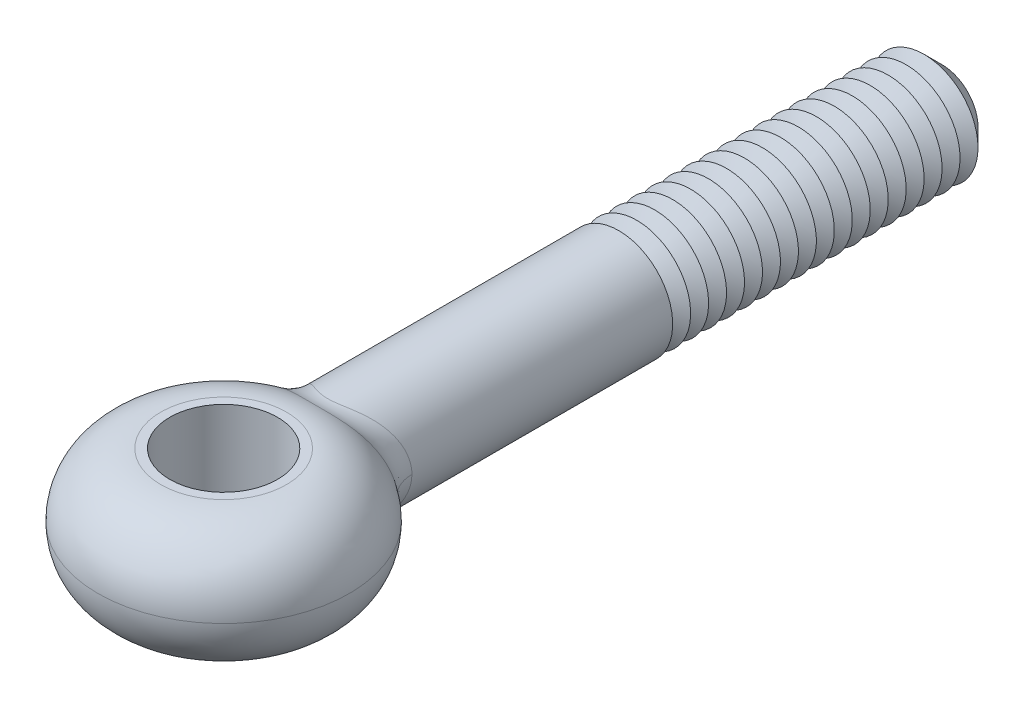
ISO-10303-21;
HEADER;
FILE_DESCRIPTION(('STEP AP214'),'2;1');
FILE_NAME('part.step','',(''),(''),'','','');
FILE_SCHEMA(('AUTOMOTIVE_DESIGN { 1 0 10303 214 1 1 1 1 }'));
ENDSEC;
DATA;
#1=APPLICATION_CONTEXT('core data for automotive mechanical design processes');
#2=APPLICATION_PROTOCOL_DEFINITION('international standard','automotive_design',2000,#1);
#3=PRODUCT_CONTEXT('',#1,'mechanical');
#4=PRODUCT('Part','Part','',(#3));
#5=PRODUCT_RELATED_PRODUCT_CATEGORY('part','',(#4));
#6=PRODUCT_DEFINITION_FORMATION('','',#4);
#7=PRODUCT_DEFINITION_CONTEXT('part definition',#1,'design');
#8=PRODUCT_DEFINITION('design','',#6,#7);
#9=PRODUCT_DEFINITION_SHAPE('','',#8);
#10=(LENGTH_UNIT() NAMED_UNIT(*) SI_UNIT(.MILLI.,.METRE.));
#11=(NAMED_UNIT(*) PLANE_ANGLE_UNIT() SI_UNIT($,.RADIAN.));
#12=(NAMED_UNIT(*) SI_UNIT($,.STERADIAN.) SOLID_ANGLE_UNIT());
#13=UNCERTAINTY_MEASURE_WITH_UNIT(LENGTH_MEASURE(1.E-05),#10,'distance_accuracy_value','');
#14=(GEOMETRIC_REPRESENTATION_CONTEXT(3) GLOBAL_UNCERTAINTY_ASSIGNED_CONTEXT((#13)) GLOBAL_UNIT_ASSIGNED_CONTEXT((#10,
#11,#12)) REPRESENTATION_CONTEXT('',''));
#15=CARTESIAN_POINT('',(0.,0.,0.));
#16=DIRECTION('',(0.,0.,1.));
#17=DIRECTION('',(1.,0.,0.));
#18=AXIS2_PLACEMENT_3D('',#15,#16,#17);
#19=CARTESIAN_POINT('',(0.,0.,-40.));
#20=DIRECTION('',(0.,0.,1.));
#21=DIRECTION('',(1.,0.,0.));
#22=AXIS2_PLACEMENT_3D('',#19,#20,#21);
#23=CYLINDRICAL_SURFACE('',#22,3.);
#24=CARTESIAN_POINT('',(0.,0.,-22.));
#25=DIRECTION('',(0.,0.,-1.));
#26=DIRECTION('',(-1.,0.,0.));
#27=AXIS2_PLACEMENT_3D('',#24,#25,#26);
#28=CIRCLE('',#27,3.);
#29=CARTESIAN_POINT('',(-3.,0.,-22.));
#30=VERTEX_POINT('',#29);
#31=EDGE_CURVE('E79',#30,#30,#28,.T.);
#32=ORIENTED_EDGE('',*,*,#31,.F.);
#33=EDGE_LOOP('',(#32));
#34=FACE_BOUND('',#33,.T.);
#35=CARTESIAN_POINT('',(3.20867656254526,-1.86688953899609,-5.60738897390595));
#36=CARTESIAN_POINT('',(2.56096665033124,-1.57853791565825,-6.18752111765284));
#37=CARTESIAN_POINT('',(2.42933329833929,-1.76021013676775,-7.07571927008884));
#38=CARTESIAN_POINT('',(3.2640375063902,-1.79983468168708,-5.6244390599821));
#39=CARTESIAN_POINT('',(2.59942976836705,-1.51546797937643,-6.20680511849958));
#40=CARTESIAN_POINT('',(2.47515209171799,-1.69698698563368,-7.10859962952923));
#41=CARTESIAN_POINT('',(3.31639317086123,-1.73064721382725,-5.64064739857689));
#42=CARTESIAN_POINT('',(2.6351235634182,-1.45163102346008,-6.22483857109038));
#43=CARTESIAN_POINT('',(2.51864422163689,-1.63175308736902,-7.13979554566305));
#44=CARTESIAN_POINT('',(3.41480339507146,-1.58839610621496,-5.67122752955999));
#45=CARTESIAN_POINT('',(2.70133077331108,-1.32242780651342,-6.2584928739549));
#46=CARTESIAN_POINT('',(2.60062893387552,-1.49763061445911,-7.19856096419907));
#47=CARTESIAN_POINT('',(3.46085609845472,-1.51533133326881,-5.68559878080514));
#48=CARTESIAN_POINT('',(2.73180651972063,-1.25708225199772,-6.27409557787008));
#49=CARTESIAN_POINT('',(2.63912004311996,-1.42874097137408,-7.22612939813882));
#50=CARTESIAN_POINT('',(3.546356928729,-1.3657196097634,-5.71234772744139));
#51=CARTESIAN_POINT('',(2.78768215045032,-1.12523153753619,-6.30284909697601));
#52=CARTESIAN_POINT('',(2.71074587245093,-1.28767848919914,-7.27737465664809));
#53=CARTESIAN_POINT('',(3.58580195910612,-1.28917104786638,-5.72472448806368));
#54=CARTESIAN_POINT('',(2.81304620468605,-1.05875480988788,-6.31598215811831));
#55=CARTESIAN_POINT('',(2.74387808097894,-1.21550413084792,-7.30104965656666));
#56=CARTESIAN_POINT('',(3.65776513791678,-1.13315402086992,-5.74734510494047));
#57=CARTESIAN_POINT('',(2.85880293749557,-0.925006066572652,-6.33977838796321));
#58=CARTESIAN_POINT('',(2.80443437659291,-1.06840236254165,-7.3442730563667));
#59=CARTESIAN_POINT('',(3.69028421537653,-1.05368594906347,-5.75758924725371));
#60=CARTESIAN_POINT('',(2.87916694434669,-0.857769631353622,-6.35042700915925));
#61=CARTESIAN_POINT('',(2.8318592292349,-0.993475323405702,-7.36382200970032));
#62=CARTESIAN_POINT('',(3.77515525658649,-0.816961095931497,-5.78435527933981));
#63=CARTESIAN_POINT('',(2.93190738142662,-0.65942955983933,-6.37810010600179));
#64=CARTESIAN_POINT('',(2.90352890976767,-0.770277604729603,-7.41485863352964));
#65=CARTESIAN_POINT('',(3.81771867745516,-0.656277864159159,-5.79782156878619));
#66=CARTESIAN_POINT('',(2.95751731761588,-0.527948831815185,-6.39167488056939));
#67=CARTESIAN_POINT('',(2.93960625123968,-0.618776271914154,-7.44047691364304));
#68=CARTESIAN_POINT('',(3.87457638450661,-0.330399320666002,-5.81581906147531));
#69=CARTESIAN_POINT('',(2.99160360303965,-0.264144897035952,-6.40978099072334));
#70=CARTESIAN_POINT('',(2.98783417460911,-0.311519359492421,-7.47469955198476));
#71=CARTESIAN_POINT('',(3.88889240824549,-0.165207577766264,-5.82035713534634));
#72=CARTESIAN_POINT('',(3.00000126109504,-0.132171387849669,-6.41427063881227));
#73=CARTESIAN_POINT('',(3.0000031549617,-0.155767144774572,-7.48331699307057));
#74=CARTESIAN_POINT('',(3.88888530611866,0.168184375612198,-5.82035471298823));
#75=CARTESIAN_POINT('',(2.99999871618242,0.134552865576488,-6.41426895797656));
#76=CARTESIAN_POINT('',(2.99999678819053,0.158573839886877,-7.48331251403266));
#77=CARTESIAN_POINT('',(3.87404149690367,0.336385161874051,-5.81564916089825));
#78=CARTESIAN_POINT('',(2.99129334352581,0.268928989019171,-6.40961447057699));
#79=CARTESIAN_POINT('',(2.98737884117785,0.317163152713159,-7.4743771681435));
#80=CARTESIAN_POINT('',(3.81515698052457,0.667880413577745,-5.79701135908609));
#81=CARTESIAN_POINT('',(2.9559743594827,0.537385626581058,-6.39085708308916));
#82=CARTESIAN_POINT('',(2.9374350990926,0.62971581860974,-7.4389355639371));
#83=CARTESIAN_POINT('',(3.77110419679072,0.831172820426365,-5.78307529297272));
#84=CARTESIAN_POINT('',(2.92945190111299,0.67109871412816,-6.37680244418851));
#85=CARTESIAN_POINT('',(2.90009908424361,0.783677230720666,-7.41242203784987));
#86=CARTESIAN_POINT('',(3.65533406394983,1.14793503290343,-5.74656955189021));
#87=CARTESIAN_POINT('',(2.85749109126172,0.936601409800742,-6.33906369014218));
#88=CARTESIAN_POINT('',(2.80235516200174,1.08233874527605,-7.34280559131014));
#89=CARTESIAN_POINT('',(3.58366301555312,1.30142077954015,-5.7240143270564));
#90=CARTESIAN_POINT('',(2.81227210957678,1.0680825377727,-6.31549258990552));
#91=CARTESIAN_POINT('',(2.74198587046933,1.22705387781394,-7.29973043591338));
#92=CARTESIAN_POINT('',(3.41475253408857,1.59497155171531,-5.67118021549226));
#93=CARTESIAN_POINT('',(2.70177181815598,1.32703977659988,-6.25865078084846));
#94=CARTESIAN_POINT('',(2.60051087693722,1.50383032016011,-7.19850118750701));
#95=CARTESIAN_POINT('',(3.31751497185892,1.73503755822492,-5.64090189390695));
#96=CARTESIAN_POINT('',(2.6367465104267,1.454297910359,-6.22550711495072));
#97=CARTESIAN_POINT('',(2.51940669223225,1.63589255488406,-7.14034819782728));
#98=CARTESIAN_POINT('',(3.09637392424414,2.00293825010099,-5.57280936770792));
#99=CARTESIAN_POINT('',(2.48348634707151,1.70556577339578,-6.14868274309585));
#100=CARTESIAN_POINT('',(2.33639294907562,1.88848463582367,-7.00903326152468));
#101=CARTESIAN_POINT('',(2.97172019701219,2.13024172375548,-5.53478597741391));
#102=CARTESIAN_POINT('',(2.3948646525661,1.82927288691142,-6.10483301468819));
#103=CARTESIAN_POINT('',(2.23390334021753,2.00851362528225,-6.93545250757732));
#104=CARTESIAN_POINT('',(2.69996830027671,2.3651018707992,-5.45362314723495));
#105=CARTESIAN_POINT('',(2.19516623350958,2.06511554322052,-6.0083348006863));
#106=CARTESIAN_POINT('',(2.01290711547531,2.22995319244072,-6.77759807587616));
#107=CARTESIAN_POINT('',(2.55285883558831,2.47264854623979,-5.41048113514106));
#108=CARTESIAN_POINT('',(2.08437280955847,2.17728215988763,-5.95580351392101));
#109=CARTESIAN_POINT('',(1.89439244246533,2.33135434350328,-6.69331902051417));
#110=CARTESIAN_POINT('',(2.30998722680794,2.62203371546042,-5.3420402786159));
#111=CARTESIAN_POINT('',(1.89619405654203,2.33829445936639,-5.87000214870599));
#112=CARTESIAN_POINT('',(1.70155283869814,2.47220321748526,-6.55887884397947));
#113=CARTESIAN_POINT('',(2.22150305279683,2.67143197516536,-5.3176024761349));
#114=CARTESIAN_POINT('',(1.82698546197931,2.39247654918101,-5.83902999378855));
#115=CARTESIAN_POINT('',(1.6318003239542,2.51877871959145,-6.51073776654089));
#116=CARTESIAN_POINT('',(2.03843806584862,2.76380875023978,-5.26856885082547));
#117=CARTESIAN_POINT('',(1.68220937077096,2.4954877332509,-5.77608718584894));
#118=CARTESIAN_POINT('',(1.48876141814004,2.60587682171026,-6.41385450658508));
#119=CARTESIAN_POINT('',(1.94385887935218,2.80678896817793,-5.24397307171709));
#120=CARTESIAN_POINT('',(1.60666598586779,2.54435586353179,-5.74411696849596));
#121=CARTESIAN_POINT('',(1.41547597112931,2.64640102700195,-6.36511248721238));
#122=CARTESIAN_POINT('',(1.74840195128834,2.88622799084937,-5.19533539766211));
#123=CARTESIAN_POINT('',(1.44916682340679,2.63609614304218,-5.68016772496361));
#124=CARTESIAN_POINT('',(1.26552728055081,2.72130067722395,-6.26843880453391));
#125=CARTESIAN_POINT('',(1.64751683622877,2.92267896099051,-5.17129419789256));
#126=CARTESIAN_POINT('',(1.36720978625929,2.67900755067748,-5.64817791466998));
#127=CARTESIAN_POINT('',(1.18886011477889,2.75566873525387,-6.22050817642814));
#128=CARTESIAN_POINT('',(1.43932773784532,2.9888232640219,-5.12481803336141));
#129=CARTESIAN_POINT('',(1.19698367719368,2.75798926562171,-5.58572642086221));
#130=CARTESIAN_POINT('',(1.03236587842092,2.81803336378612,-6.12758795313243));
#131=CARTESIAN_POINT('',(1.33202619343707,3.01851914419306,-5.10238246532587));
#132=CARTESIAN_POINT('',(1.10870348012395,2.79411419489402,-5.55524119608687));
#133=CARTESIAN_POINT('',(0.952540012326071,2.84603233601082,-6.08259725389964));
#134=CARTESIAN_POINT('',(1.14714488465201,3.0622946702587,-5.06741366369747));
#135=CARTESIAN_POINT('',(0.955864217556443,2.84805312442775,-5.50733016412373));
#136=CARTESIAN_POINT('',(0.81652988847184,2.88730640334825,-6.01230192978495));
#137=CARTESIAN_POINT('',(1.0713798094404,3.07829978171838,-5.05404848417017));
#138=CARTESIAN_POINT('',(0.893090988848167,2.86798092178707,-5.48891166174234));
#139=CARTESIAN_POINT('',(0.761192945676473,2.90239693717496,-5.98538526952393));
#140=CARTESIAN_POINT('',(0.916863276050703,3.10704015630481,-5.02923110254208));
#141=CARTESIAN_POINT('',(0.764832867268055,2.90402976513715,-5.45456574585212));
#142=CARTESIAN_POINT('',(0.649139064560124,2.92949500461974,-5.93533347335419));
#143=CARTESIAN_POINT('',(0.838111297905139,3.1197748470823,-5.01777923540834));
#144=CARTESIAN_POINT('',(0.69932722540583,2.92016650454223,-5.43862583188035));
#145=CARTESIAN_POINT('',(0.592421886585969,2.94150199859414,-5.91219899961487));
#146=CARTESIAN_POINT('',(0.6782293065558,3.14177269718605,-4.99746218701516));
#147=CARTESIAN_POINT('',(0.56619562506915,2.94820006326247,-5.41026040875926));
#148=CARTESIAN_POINT('',(0.477997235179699,2.96224282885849,-5.87111000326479));
#149=CARTESIAN_POINT('',(0.597112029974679,3.15105169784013,-4.98858524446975));
#150=CARTESIAN_POINT('',(0.49855284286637,2.96013078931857,-5.39780561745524));
#151=CARTESIAN_POINT('',(0.42029558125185,2.970991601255,-5.85313193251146));
#152=CARTESIAN_POINT('',(0.432732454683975,3.16605777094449,-4.9739751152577));
#153=CARTESIAN_POINT('',(0.361419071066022,2.97949280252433,-5.377273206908));
#154=CARTESIAN_POINT('',(0.303924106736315,2.98514018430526,-5.82352161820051));
#155=CARTESIAN_POINT('',(0.34947150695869,3.17178702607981,-4.96823999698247));
#156=CARTESIAN_POINT('',(0.291891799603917,2.98693839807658,-5.36918117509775));
#157=CARTESIAN_POINT('',(0.245254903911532,2.9905420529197,-5.81188547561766));
#158=CARTESIAN_POINT('',(0.180705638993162,3.17961288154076,-4.96035475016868));
#159=CARTESIAN_POINT('',(0.150966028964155,2.99711750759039,-5.35805376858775));
#160=CARTESIAN_POINT('',(0.126651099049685,2.99792071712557,-5.79588271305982));
#161=CARTESIAN_POINT('',(0.0951859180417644,3.18166687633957,-4.95824667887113));
#162=CARTESIAN_POINT('',(0.0795084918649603,2.99980259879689,-5.35507030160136));
#163=CARTESIAN_POINT('',(0.0667097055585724,2.99985734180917,-5.79160137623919));
#164=CARTESIAN_POINT('',(-0.0758990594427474,3.18195333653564,-4.95795434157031));
#165=CARTESIAN_POINT('',(-0.0633965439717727,3.00017632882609,-5.35465714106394));
#166=CARTESIAN_POINT('',(-0.0531929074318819,3.00012743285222,-5.79100779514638));
#167=CARTESIAN_POINT('',(-0.161464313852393,3.18018596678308,-4.95976990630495));
#168=CARTESIAN_POINT('',(-0.134893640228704,2.99786544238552,-5.35722692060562));
#169=CARTESIAN_POINT('',(-0.113154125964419,2.99846105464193,-5.79469520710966));
#170=CARTESIAN_POINT('',(-0.331649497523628,3.17286894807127,-4.96715548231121));
#171=CARTESIAN_POINT('',(-0.277011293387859,2.98834413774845,-5.36765144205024));
#172=CARTESIAN_POINT('',(-0.232710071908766,2.99156215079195,-5.80968494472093));
#173=CARTESIAN_POINT('',(-0.416265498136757,3.16730714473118,-4.97273755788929));
#174=CARTESIAN_POINT('',(-0.347675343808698,2.98111153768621,-5.37553016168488));
#175=CARTESIAN_POINT('',(-0.292302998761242,2.98631816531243,-5.82101173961));
#176=CARTESIAN_POINT('',(-0.583319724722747,3.15252271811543,-4.98717042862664));
#177=CARTESIAN_POINT('',(-0.487052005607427,2.96202363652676,-5.3958201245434));
#178=CARTESIAN_POINT('',(-0.410500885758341,2.97237856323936,-5.85026594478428));
#179=CARTESIAN_POINT('',(-0.665756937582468,3.1432984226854,-4.99602271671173));
#180=CARTESIAN_POINT('',(-0.555803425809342,2.9501544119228,-5.40824549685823));
#181=CARTESIAN_POINT('',(-0.469105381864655,2.96368137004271,-5.86819636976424));
#182=CARTESIAN_POINT('',(-0.852542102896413,3.11800936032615,-5.01944463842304));
#183=CARTESIAN_POINT('',(-0.711397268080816,2.91789597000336,-5.44096622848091));
#184=CARTESIAN_POINT('',(-0.602710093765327,2.9398373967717,-5.91556991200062));
#185=CARTESIAN_POINT('',(-0.955914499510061,3.10071678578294,-5.03493446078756));
#186=CARTESIAN_POINT('',(-0.797372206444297,2.89599454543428,-5.46252153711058));
#187=CARTESIAN_POINT('',(-0.677266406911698,2.92353296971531,-5.9468562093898));
#188=CARTESIAN_POINT('',(-1.15747034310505,3.06050331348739,-5.06896237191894));
#189=CARTESIAN_POINT('',(-0.96448946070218,2.84579648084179,-5.50948574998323));
#190=CARTESIAN_POINT('',(-0.82399035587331,2.88561741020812,-6.01542593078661));
#191=CARTESIAN_POINT('',(-1.25565167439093,3.03758014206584,-5.08750169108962));
#192=CARTESIAN_POINT('',(-1.04567094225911,2.81745945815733,-5.53492466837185));
#193=CARTESIAN_POINT('',(-0.896157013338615,2.8640041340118,-6.05271177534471));
#194=CARTESIAN_POINT('',(-1.44701488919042,2.98629407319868,-5.12649976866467));
#195=CARTESIAN_POINT('',(-1.20319716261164,2.75504714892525,-5.58794679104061));
#196=CARTESIAN_POINT('',(-1.03815002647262,2.8156486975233,-6.130943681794));
#197=CARTESIAN_POINT('',(-1.54018815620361,2.95792216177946,-5.1469616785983));
#198=CARTESIAN_POINT('',(-1.27955391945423,2.72092467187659,-5.61555495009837));
#199=CARTESIAN_POINT('',(-1.10797227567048,2.78889803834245,-6.17189574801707));
#200=CARTESIAN_POINT('',(-1.72151711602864,2.89592293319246,-5.18889273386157));
#201=CARTESIAN_POINT('',(-1.42727129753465,2.64757180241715,-5.67156834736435));
#202=CARTESIAN_POINT('',(-1.24508737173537,2.73044162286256,-6.25559228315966));
#203=CARTESIAN_POINT('',(-1.80967353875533,2.86229638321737,-5.21036173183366));
#204=CARTESIAN_POINT('',(-1.49863783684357,2.60830676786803,-5.69998707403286));
#205=CARTESIAN_POINT('',(-1.31238058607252,2.69873658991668,-6.29833648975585));
#206=CARTESIAN_POINT('',(-1.98571143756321,2.78796010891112,-5.25480393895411));
#207=CARTESIAN_POINT('',(-1.64009897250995,2.52294667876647,-5.75819924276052));
#208=CARTESIAN_POINT('',(-1.44787080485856,2.62864810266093,-6.38658240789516));
#209=CARTESIAN_POINT('',(-2.07332759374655,2.746968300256,-5.27779631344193));
#210=CARTESIAN_POINT('',(-1.70989675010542,2.47657447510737,-5.78798453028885));
#211=CARTESIAN_POINT('',(-1.51592466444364,2.58999868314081,-6.43210962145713));
#212=CARTESIAN_POINT('',(-2.2432391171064,2.65939261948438,-5.32358826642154));
#213=CARTESIAN_POINT('',(-1.84397839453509,2.37927832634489,-5.846613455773));
#214=CARTESIAN_POINT('',(-1.64892099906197,2.50742732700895,-6.52253244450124));
#215=CARTESIAN_POINT('',(-2.32553297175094,2.61280716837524,-5.34638778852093));
#216=CARTESIAN_POINT('',(-1.90824127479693,2.32832315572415,-5.87545589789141));
#217=CARTESIAN_POINT('',(-1.71386258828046,2.46350390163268,-6.56742787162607));
#218=CARTESIAN_POINT('',(-2.5641633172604,2.46496130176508,-5.41374113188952));
#219=CARTESIAN_POINT('',(-2.09300733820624,2.16915106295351,-5.95982947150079));
#220=CARTESIAN_POINT('',(-1.90344199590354,2.32410637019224,-6.69970299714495));
#221=CARTESIAN_POINT('',(-2.71256686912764,2.35547619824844,-5.4573335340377));
#222=CARTESIAN_POINT('',(-2.20461350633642,2.05516387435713,-6.01283232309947));
#223=CARTESIAN_POINT('',(-2.02308115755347,2.2208775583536,-6.78483780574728));
#224=CARTESIAN_POINT('',(-3.00301596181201,2.10163957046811,-5.54419617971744));
#225=CARTESIAN_POINT('',(-2.41778154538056,1.80070495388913,-6.11598887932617));
#226=CARTESIAN_POINT('',(-2.25944200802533,1.98154588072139,-6.95372540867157));
#227=CARTESIAN_POINT('',(-3.1420990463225,1.95466818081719,-5.58678396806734));
#228=CARTESIAN_POINT('',(-2.51591581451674,1.65883259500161,-6.16477103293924));
#229=CARTESIAN_POINT('',(-2.37404369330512,1.84297285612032,-7.03605392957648));
#230=CARTESIAN_POINT('',(-3.38785298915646,1.63858571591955,-5.66272580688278));
#231=CARTESIAN_POINT('',(-2.68453053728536,1.36565972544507,-6.24972770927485));
#232=CARTESIAN_POINT('',(-2.57792192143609,1.54495224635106,-7.18232146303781));
#233=CARTESIAN_POINT('',(-3.49450592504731,1.46946247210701,-5.69607475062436));
#234=CARTESIAN_POINT('',(-2.75453740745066,1.21455209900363,-6.28567815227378));
#235=CARTESIAN_POINT('',(-2.66718445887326,1.38549318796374,-7.24625030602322));
#236=CARTESIAN_POINT('',(-3.66380219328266,1.1299583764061,-5.74921606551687));
#237=CARTESIAN_POINT('',(-2.86316402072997,0.920881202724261,-6.3419757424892));
#238=CARTESIAN_POINT('',(-2.8094401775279,1.06538932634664,-7.34787971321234));
#239=CARTESIAN_POINT('',(-3.72945621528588,0.960953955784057,-5.76993212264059));
#240=CARTESIAN_POINT('',(-2.90370657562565,0.778947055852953,-6.36326874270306));
#241=CARTESIAN_POINT('',(-2.86490429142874,0.906042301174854,-7.38737179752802));
#242=CARTESIAN_POINT('',(-3.82803878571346,0.614436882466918,-5.80107948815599));
#243=CARTESIAN_POINT('',(-2.96393533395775,0.493368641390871,-6.39505004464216));
#244=CARTESIAN_POINT('',(-2.94832898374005,0.5793262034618,-7.44668580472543));
#245=CARTESIAN_POINT('',(-3.86106115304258,0.436950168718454,-5.81154028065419));
#246=CARTESIAN_POINT('',(-2.98349655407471,0.350141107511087,-6.40547274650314));
#247=CARTESIAN_POINT('',(-2.97636840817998,0.411981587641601,-7.46656411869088));
#248=CARTESIAN_POINT('',(-3.88111578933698,0.215363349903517,-5.81789329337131));
#249=CARTESIAN_POINT('',(-2.99539251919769,0.172394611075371,-6.41181290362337));
#250=CARTESIAN_POINT('',(-2.99339822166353,0.203056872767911,-7.47863586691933));
#251=CARTESIAN_POINT('',(-3.88402884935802,0.172339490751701,-5.81881611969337));
#252=CARTESIAN_POINT('',(-2.99712106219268,0.137923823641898,-6.41273432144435));
#253=CARTESIAN_POINT('',(-2.99587203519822,0.16249151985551,-7.48038932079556));
#254=CARTESIAN_POINT('',(-3.88791595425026,0.0862156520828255,-5.82004764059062));
#255=CARTESIAN_POINT('',(-2.99942439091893,0.0689697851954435,-6.41396268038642));
#256=CARTESIAN_POINT('',(-2.99917350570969,0.0812890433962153,-7.48272910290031));
#257=CARTESIAN_POINT('',(-3.88889040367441,0.0431156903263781,-5.82035646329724));
#258=CARTESIAN_POINT('',(-2.99999898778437,0.0344929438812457,-6.41426952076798));
#259=CARTESIAN_POINT('',(-3.00000150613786,0.0406519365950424,-7.48331567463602));
#260=CARTESIAN_POINT('',(-3.88888299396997,-0.167788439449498,-5.82035387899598));
#261=CARTESIAN_POINT('',(-3.00000393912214,-0.134232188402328,-6.41427091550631));
#262=CARTESIAN_POINT('',(-2.9999941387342,-0.15820052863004,-7.48331126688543));
#263=CARTESIAN_POINT('',(-3.87409666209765,-0.335815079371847,-5.81566687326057));
#264=CARTESIAN_POINT('',(-2.99132704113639,-0.268467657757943,-6.40963250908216));
#265=CARTESIAN_POINT('',(-2.98742586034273,-0.316625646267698,-7.47441080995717));
#266=CARTESIAN_POINT('',(-3.81528095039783,-0.667441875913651,-5.79705034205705));
#267=CARTESIAN_POINT('',(-2.95604795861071,-0.537030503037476,-6.39089602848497));
#268=CARTESIAN_POINT('',(-2.93754001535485,-0.629302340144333,-7.43900973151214));
#269=CARTESIAN_POINT('',(-3.77115080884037,-0.831024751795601,-5.78308897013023));
#270=CARTESIAN_POINT('',(-2.92948278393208,-0.670988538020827,-6.3768176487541));
#271=CARTESIAN_POINT('',(-2.90013717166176,-0.783537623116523,-7.41244846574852));
#272=CARTESIAN_POINT('',(-3.68420709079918,-1.06894491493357,-5.75567457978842));
#273=CARTESIAN_POINT('',(-2.87536500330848,-0.870652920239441,-6.34843788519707));
#274=CARTESIAN_POINT('',(-2.82673309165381,-1.00786234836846,-7.36016870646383));
#275=CARTESIAN_POINT('',(-3.65178721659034,-1.14697548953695,-5.74546383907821));
#276=CARTESIAN_POINT('',(-2.85503050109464,-0.936773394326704,-6.33781082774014));
#277=CARTESIAN_POINT('',(-2.79939811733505,-1.08143403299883,-7.34068082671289));
#278=CARTESIAN_POINT('',(-3.58025604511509,-1.30018288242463,-5.72298379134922));
#279=CARTESIAN_POINT('',(-2.80948516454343,-1.06829583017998,-6.31413687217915));
#280=CARTESIAN_POINT('',(-2.73921822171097,-1.22588671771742,-7.29772059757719));
#281=CARTESIAN_POINT('',(-3.54114381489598,-1.37535930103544,-5.71071419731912));
#282=CARTESIAN_POINT('',(-2.78430184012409,-1.13366420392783,-6.30110391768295));
#283=CARTESIAN_POINT('',(-2.70637253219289,-1.29676734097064,-7.27424769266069));
#284=CARTESIAN_POINT('',(-3.45663845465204,-1.52213332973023,-5.68428226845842));
#285=CARTESIAN_POINT('',(-2.72901827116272,-1.26315433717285,-6.27266712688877));
#286=CARTESIAN_POINT('',(-2.63559380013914,-1.43515428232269,-7.22360441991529));
#287=CARTESIAN_POINT('',(-3.41126467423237,-1.59374107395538,-5.67012576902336));
#288=CARTESIAN_POINT('',(-2.69896514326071,-1.32725151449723,-6.25728646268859));
#289=CARTESIAN_POINT('',(-2.59767644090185,-1.50267015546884,-7.19644544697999));
#290=CARTESIAN_POINT('',(-3.31444986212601,-1.73321286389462,-5.64004567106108));
#291=CARTESIAN_POINT('',(-2.63379544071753,-1.4540048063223,-6.22416747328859));
#292=CARTESIAN_POINT('',(-2.51702985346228,-1.63417212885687,-7.13863740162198));
#293=CARTESIAN_POINT('',(-3.26301063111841,-1.80107801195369,-5.62412259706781));
#294=CARTESIAN_POINT('',(-2.59871455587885,-1.51664149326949,-6.20644633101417));
#295=CARTESIAN_POINT('',(-2.47430205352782,-1.69815926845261,-7.10798936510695));
#296=CARTESIAN_POINT('',(-3.20867656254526,-1.86688953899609,-5.60738897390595));
#297=CARTESIAN_POINT('',(-2.56096665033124,-1.57853791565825,-6.18752111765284));
#298=CARTESIAN_POINT('',(-2.42933329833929,-1.76021013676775,-7.07571927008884));
#299=(BOUNDED_SURFACE() B_SPLINE_SURFACE(3,2,((#35,#36,#37),(#38,#39,#40),(#41,#42,#43),(#44,
#45,#46),(#47,#48,#49),(#50,#51,#52),(#53,#54,#55),(#56,#57,#58),(#59,#60,#61),(#62,#63,#64),
(#65,#66,#67),(#68,#69,#70),(#71,#72,#73),(#74,#75,#76),(#77,#78,#79),(#80,#81,#82),(#83,#84,
#85),(#86,#87,#88),(#89,#90,#91),(#92,#93,#94),(#95,#96,#97),(#98,#99,#100),(#101,#102,#103),
(#104,#105,#106),(#107,#108,#109),(#110,#111,#112),(#113,#114,#115),(#116,#117,#118),(#119,#120,
#121),(#122,#123,#124),(#125,#126,#127),(#128,#129,#130),(#131,#132,#133),(#134,#135,#136),
(#137,#138,#139),(#140,#141,#142),(#143,#144,#145),(#146,#147,#148),(#149,#150,#151),(#152,#153,
#154),(#155,#156,#157),(#158,#159,#160),(#161,#162,#163),(#164,#165,#166),(#167,#168,#169),
(#170,#171,#172),(#173,#174,#175),(#176,#177,#178),(#179,#180,#181),(#182,#183,#184),(#185,#186,
#187),(#188,#189,#190),(#191,#192,#193),(#194,#195,#196),(#197,#198,#199),(#200,#201,#202),
(#203,#204,#205),(#206,#207,#208),(#209,#210,#211),(#212,#213,#214),(#215,#216,#217),(#218,#219,
#220),(#221,#222,#223),(#224,#225,#226),(#227,#228,#229),(#230,#231,#232),(#233,#234,#235),
(#236,#237,#238),(#239,#240,#241),(#242,#243,#244),(#245,#246,#247),(#248,#249,#250),(#251,#252,
#253),(#254,#255,#256),(#257,#258,#259),(#260,#261,#262),(#263,#264,#265),(#266,#267,#268),
(#269,#270,#271),(#272,#273,#274),(#275,#276,#277),(#278,#279,#280),(#281,#282,#283),(#284,#285,
#286),(#287,#288,#289),(#290,#291,#292),(#293,#294,#295),(#296,#297,#298)),.UNSPECIFIED.,.F.,
.F.,.F.) B_SPLINE_SURFACE_WITH_KNOTS((4,2,2,2,2,2,2,2,2,2,2,2,2,2,2,2,2,2,2,2,2,2,2,2,2,2,2,2,2,
2,2,2,2,2,2,2,2,2,2,2,2,2,2,4),(3,3),(0.,0.402578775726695,0.805275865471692,1.20816114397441,
1.61099234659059,2.38951834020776,3.16744499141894,3.95938873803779,4.75166012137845,
5.54260903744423,6.33350009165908,7.14956449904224,7.96604074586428,8.40919064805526,
8.8522227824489,9.29578301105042,9.7391756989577,10.0369232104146,10.334722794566,
10.6311399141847,10.9273745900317,11.2270216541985,11.5266557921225,11.8272542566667,
12.1279901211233,12.5203401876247,12.9128489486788,13.3060127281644,13.6991191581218,
14.1131872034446,14.5273724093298,15.3542822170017,16.2816457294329,17.2095208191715,
18.0570670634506,18.9021693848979,19.1054047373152,19.3085976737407,20.0993405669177,
20.8928128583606,21.2891887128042,21.6856198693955,22.0808523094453,22.4759677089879),(0.,1.),
.UNSPECIFIED.) GEOMETRIC_REPRESENTATION_ITEM() RATIONAL_B_SPLINE_SURFACE(((1.,0.909163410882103,
1.),(1.,0.907082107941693,1.),(1.,0.905079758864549,1.),(1.,0.901265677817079,1.),(1.,
0.899454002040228,1.),(1.,0.896054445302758,1.),(1.,0.894466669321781,1.),(1.,0.8915452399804,
1.),(1.,0.890211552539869,1.),(1.,0.8867092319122,1.),(1.,0.884921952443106,1.),(1.,
0.882526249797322,1.),(1.,0.881916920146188,1.),(1.,0.881917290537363,1.),(1.,0.882549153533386,
1.),(1.,0.885029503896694,1.),(1.,0.88687849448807,1.),(1.,0.891651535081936,1.),(1.,
0.894573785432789,1.),(1.,0.901284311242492,1.),(1.,0.905072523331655,1.),(1.,0.913384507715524,
1.),(1.,0.917927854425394,1.),(1.,0.927337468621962,1.),(1.,0.932203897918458,1.),(1.,
0.93966862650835,1.),(1.,0.942286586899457,1.),(1.,0.947441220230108,1.),(1.,0.949977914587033,
1.),(1.,0.954897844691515,1.),(1.,0.957280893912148,1.),(1.,0.961800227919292,1.),(1.,
0.963936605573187,1.),(1.,0.967208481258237,1.),(1.,0.968442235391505,1.),(1.,0.970708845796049,
1.),(1.,0.97174166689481,1.),(1.,0.973558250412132,1.),(1.,0.974343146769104,1.),(1.,
0.975627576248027,1.),(1.,0.976127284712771,1.),(1.,0.976812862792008,1.),(1.,0.976995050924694,
1.),(1.,0.977020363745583,1.),(1.,0.976863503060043,1.),(1.,0.976221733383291,1.),(1.,
0.975735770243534,1.),(1.,0.974468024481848,1.),(1.,0.973686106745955,1.),(1.,0.971593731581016,
1.),(1.,0.970194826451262,1.),(1.,0.967067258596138,1.),(1.,0.965338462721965,1.),(1.,
0.961634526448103,1.),(1.,0.959658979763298,1.),(1.,0.955535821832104,1.),(1.,0.95338823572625,
1.),(1.,0.948862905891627,1.),(1.,0.946478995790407,1.),(1.,0.941646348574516,1.),(1.,
0.939197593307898,1.),(1.,0.931841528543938,1.),(1.,0.926915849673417,1.),(1.,0.916826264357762,
1.),(1.,0.911706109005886,1.),(1.,0.902364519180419,1.),(1.,0.898143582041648,1.),(1.,
0.891316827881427,1.),(1.,0.888602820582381,1.),(1.,0.884494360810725,1.),(1.,0.883096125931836,
1.),(1.,0.882246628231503,1.),(1.,0.882123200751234,1.),(1.,0.881958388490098,1.),(1.,
0.881916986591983,1.),(1.,0.881917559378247,1.),(1.,0.88254679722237,1.),(1.,0.885024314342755,
1.),(1.,0.886876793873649,1.),(1.,0.890461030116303,1.),(1.,0.89178924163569,1.),(1.,
0.894690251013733,1.),(1.,0.896263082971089,1.),(1.,0.899620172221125,1.),(1.,0.90140377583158,
1.),(1.,0.905154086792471,1.),(1.,0.907120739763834,1.),(1.,0.909163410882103,1.))) REPRESENTATION_ITEM('') SURFACE());
#300=CARTESIAN_POINT('',(-2.42933329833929,-1.76021013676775,-7.07571927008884));
#301=CARTESIAN_POINT('',(-2.47430205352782,-1.69815926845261,-7.10798936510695));
#302=CARTESIAN_POINT('',(-2.51702985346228,-1.63417212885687,-7.13863740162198));
#303=CARTESIAN_POINT('',(-2.59767644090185,-1.50267015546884,-7.19644544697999));
#304=CARTESIAN_POINT('',(-2.63559380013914,-1.43515428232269,-7.22360441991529));
#305=CARTESIAN_POINT('',(-2.70637253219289,-1.29676734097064,-7.27424769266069));
#306=CARTESIAN_POINT('',(-2.73921822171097,-1.22588671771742,-7.29772059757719));
#307=CARTESIAN_POINT('',(-2.79939811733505,-1.08143403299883,-7.34068082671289));
#308=CARTESIAN_POINT('',(-2.82673309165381,-1.00786234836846,-7.36016870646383));
#309=CARTESIAN_POINT('',(-2.90013717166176,-0.783537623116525,-7.41244846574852));
#310=CARTESIAN_POINT('',(-2.93754001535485,-0.629302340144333,-7.43900973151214));
#311=CARTESIAN_POINT('',(-2.98742586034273,-0.316625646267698,-7.47441080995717));
#312=CARTESIAN_POINT('',(-2.9999941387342,-0.158200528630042,-7.48331126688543));
#313=CARTESIAN_POINT('',(-3.00000150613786,0.0406519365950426,-7.48331567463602));
#314=CARTESIAN_POINT('',(-2.99917350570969,0.0812890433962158,-7.48272910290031));
#315=CARTESIAN_POINT('',(-2.99587203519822,0.162491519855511,-7.48038932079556));
#316=CARTESIAN_POINT('',(-2.99339822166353,0.203056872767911,-7.47863586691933));
#317=CARTESIAN_POINT('',(-2.97636840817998,0.411981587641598,-7.46656411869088));
#318=CARTESIAN_POINT('',(-2.94832898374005,0.579326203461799,-7.44668580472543));
#319=CARTESIAN_POINT('',(-2.86490429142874,0.906042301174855,-7.38737179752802));
#320=CARTESIAN_POINT('',(-2.8094401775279,1.06538932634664,-7.34787971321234));
#321=CARTESIAN_POINT('',(-2.66718445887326,1.38549318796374,-7.24625030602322));
#322=CARTESIAN_POINT('',(-2.57792192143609,1.54495224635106,-7.18232146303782));
#323=CARTESIAN_POINT('',(-2.37404369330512,1.84297285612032,-7.03605392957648));
#324=CARTESIAN_POINT('',(-2.25944200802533,1.98154588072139,-6.95372540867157));
#325=CARTESIAN_POINT('',(-2.02308115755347,2.2208775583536,-6.78483780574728));
#326=CARTESIAN_POINT('',(-1.90344199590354,2.32410637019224,-6.69970299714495));
#327=CARTESIAN_POINT('',(-1.71386258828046,2.46350390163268,-6.56742787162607));
#328=CARTESIAN_POINT('',(-1.64892099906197,2.50742732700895,-6.52253244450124));
#329=CARTESIAN_POINT('',(-1.51592466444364,2.58999868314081,-6.43210962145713));
#330=CARTESIAN_POINT('',(-1.44787080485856,2.62864810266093,-6.38658240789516));
#331=CARTESIAN_POINT('',(-1.31238058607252,2.69873658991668,-6.29833648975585));
#332=CARTESIAN_POINT('',(-1.24508737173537,2.73044162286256,-6.25559228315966));
#333=CARTESIAN_POINT('',(-1.10797227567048,2.78889803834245,-6.17189574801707));
#334=CARTESIAN_POINT('',(-1.03815002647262,2.8156486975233,-6.130943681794));
#335=CARTESIAN_POINT('',(-0.896157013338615,2.8640041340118,-6.05271177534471));
#336=CARTESIAN_POINT('',(-0.82399035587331,2.88561741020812,-6.01542593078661));
#337=CARTESIAN_POINT('',(-0.677266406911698,2.92353296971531,-5.9468562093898));
#338=CARTESIAN_POINT('',(-0.602710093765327,2.9398373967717,-5.91556991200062));
#339=CARTESIAN_POINT('',(-0.469105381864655,2.96368137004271,-5.86819636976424));
#340=CARTESIAN_POINT('',(-0.410500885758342,2.97237856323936,-5.85026594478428));
#341=CARTESIAN_POINT('',(-0.292302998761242,2.98631816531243,-5.82101173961));
#342=CARTESIAN_POINT('',(-0.232710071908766,2.99156215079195,-5.80968494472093));
#343=CARTESIAN_POINT('',(-0.113154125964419,2.99846105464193,-5.79469520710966));
#344=CARTESIAN_POINT('',(-0.0531929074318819,3.00012743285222,-5.79100779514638));
#345=CARTESIAN_POINT('',(0.0667097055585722,2.99985734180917,-5.79160137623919));
#346=CARTESIAN_POINT('',(0.126651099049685,2.99792071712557,-5.79588271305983));
#347=CARTESIAN_POINT('',(0.245254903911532,2.9905420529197,-5.81188547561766));
#348=CARTESIAN_POINT('',(0.303924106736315,2.98514018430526,-5.82352161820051));
#349=CARTESIAN_POINT('',(0.42029558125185,2.970991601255,-5.85313193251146));
#350=CARTESIAN_POINT('',(0.477997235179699,2.96224282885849,-5.87111000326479));
#351=CARTESIAN_POINT('',(0.592421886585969,2.94150199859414,-5.91219899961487));
#352=CARTESIAN_POINT('',(0.649139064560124,2.92949500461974,-5.93533347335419));
#353=CARTESIAN_POINT('',(0.761192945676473,2.90239693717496,-5.98538526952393));
#354=CARTESIAN_POINT('',(0.81652988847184,2.88730640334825,-6.01230192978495));
#355=CARTESIAN_POINT('',(0.952540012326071,2.84603233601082,-6.08259725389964));
#356=CARTESIAN_POINT('',(1.03236587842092,2.81803336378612,-6.12758795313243));
#357=CARTESIAN_POINT('',(1.18886011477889,2.75566873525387,-6.22050817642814));
#358=CARTESIAN_POINT('',(1.26552728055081,2.72130067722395,-6.26843880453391));
#359=CARTESIAN_POINT('',(1.41547597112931,2.64640102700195,-6.36511248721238));
#360=CARTESIAN_POINT('',(1.48876141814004,2.60587682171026,-6.41385450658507));
#361=CARTESIAN_POINT('',(1.6318003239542,2.51877871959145,-6.51073776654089));
#362=CARTESIAN_POINT('',(1.70155283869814,2.47220321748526,-6.55887884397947));
#363=CARTESIAN_POINT('',(1.89439244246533,2.33135434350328,-6.69331902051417));
#364=CARTESIAN_POINT('',(2.01290711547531,2.22995319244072,-6.77759807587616));
#365=CARTESIAN_POINT('',(2.23390334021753,2.00851362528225,-6.93545250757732));
#366=CARTESIAN_POINT('',(2.33639294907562,1.88848463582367,-7.00903326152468));
#367=CARTESIAN_POINT('',(2.51940669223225,1.63589255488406,-7.14034819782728));
#368=CARTESIAN_POINT('',(2.60051087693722,1.50383032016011,-7.19850118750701));
#369=CARTESIAN_POINT('',(2.74198587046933,1.22705387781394,-7.29973043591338));
#370=CARTESIAN_POINT('',(2.80235516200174,1.08233874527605,-7.34280559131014));
#371=CARTESIAN_POINT('',(2.90009908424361,0.783677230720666,-7.41242203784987));
#372=CARTESIAN_POINT('',(2.9374350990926,0.62971581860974,-7.4389355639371));
#373=CARTESIAN_POINT('',(2.98737884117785,0.317163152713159,-7.4743771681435));
#374=CARTESIAN_POINT('',(2.99999678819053,0.158573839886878,-7.48331251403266));
#375=CARTESIAN_POINT('',(3.0000031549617,-0.155767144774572,-7.48331699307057));
#376=CARTESIAN_POINT('',(2.98783417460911,-0.311519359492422,-7.47469955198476));
#377=CARTESIAN_POINT('',(2.93960625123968,-0.618776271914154,-7.44047691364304));
#378=CARTESIAN_POINT('',(2.90352890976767,-0.770277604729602,-7.41485863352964));
#379=CARTESIAN_POINT('',(2.8318592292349,-0.993475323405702,-7.36382200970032));
#380=CARTESIAN_POINT('',(2.80443437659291,-1.06840236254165,-7.3442730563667));
#381=CARTESIAN_POINT('',(2.74387808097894,-1.21550413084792,-7.30104965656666));
#382=CARTESIAN_POINT('',(2.71074587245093,-1.28767848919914,-7.27737465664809));
#383=CARTESIAN_POINT('',(2.63912004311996,-1.42874097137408,-7.22612939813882));
#384=CARTESIAN_POINT('',(2.60062893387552,-1.49763061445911,-7.19856096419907));
#385=CARTESIAN_POINT('',(2.51864422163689,-1.63175308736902,-7.13979554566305));
#386=CARTESIAN_POINT('',(2.47515209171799,-1.69698698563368,-7.10859962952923));
#387=CARTESIAN_POINT('',(2.42933329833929,-1.76021013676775,-7.07571927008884));
#388=B_SPLINE_CURVE_WITH_KNOTS('',3,(#300,#301,#302,#303,#304,#305,#306,#307,#308,#309,#310,
#311,#312,#313,#314,#315,#316,#317,#318,#319,#320,#321,#322,#323,#324,#325,#326,#327,#328,#329,
#330,#331,#332,#333,#334,#335,#336,#337,#338,#339,#340,#341,#342,#343,#344,#345,#346,#347,#348,
#349,#350,#351,#352,#353,#354,#355,#356,#357,#358,#359,#360,#361,#362,#363,#364,#365,#366,#367,
#368,#369,#370,#371,#372,#373,#374,#375,#376,#377,#378,#379,#380,#381,#382,#383,#384,#385,#386,
#387),.UNSPECIFIED.,.F.,.F.,(4,2,2,2,2,2,2,2,2,2,2,2,2,2,2,2,2,2,2,2,2,2,2,2,2,2,2,2,2,2,2,2,2,
2,2,2,2,2,2,2,2,2,2,4),(0.,0.395115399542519,0.79034783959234,1.18677899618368,1.58315485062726,
2.37662714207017,3.16737003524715,3.3705629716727,3.57379832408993,4.41890064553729,
5.26644688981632,6.19432197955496,7.12168549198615,7.94859529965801,8.36278050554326,
8.7768485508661,9.16995498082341,9.56311876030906,9.95562752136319,10.3479775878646,
10.6487134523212,10.9493119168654,11.2489460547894,11.5485931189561,11.8448277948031,
12.1412449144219,12.4390444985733,12.7367920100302,13.1801846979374,13.623744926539,
14.0667770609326,14.5099269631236,15.3264032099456,16.1424676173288,16.9333586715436,
17.7243075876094,18.5165789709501,19.3085227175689,20.0864493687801,20.8649753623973,
21.2678065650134,21.6706918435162,22.0733889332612,22.4759677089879),.UNSPECIFIED.);
#389=CARTESIAN_POINT('',(-3.,0.,-7.48331477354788));
#390=VERTEX_POINT('',#389);
#391=CARTESIAN_POINT('',(3.,0.,-7.48331477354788));
#392=VERTEX_POINT('',#391);
#393=EDGE_CURVE('E81',#390,#392,#388,.T.);
#394=ORIENTED_EDGE('',*,*,#393,.T.);
#395=CARTESIAN_POINT('',(-3.20867656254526,1.86688953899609,-5.60738897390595));
#396=CARTESIAN_POINT('',(-2.56096665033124,1.57853791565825,-6.18752111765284));
#397=CARTESIAN_POINT('',(-2.42933329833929,1.76021013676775,-7.07571927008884));
#398=CARTESIAN_POINT('',(-3.2640375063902,1.79983468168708,-5.6244390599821));
#399=CARTESIAN_POINT('',(-2.59942976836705,1.51546797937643,-6.20680511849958));
#400=CARTESIAN_POINT('',(-2.47515209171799,1.69698698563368,-7.10859962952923));
#401=CARTESIAN_POINT('',(-3.31639317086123,1.73064721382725,-5.64064739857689));
#402=CARTESIAN_POINT('',(-2.6351235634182,1.45163102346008,-6.22483857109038));
#403=CARTESIAN_POINT('',(-2.51864422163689,1.63175308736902,-7.13979554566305));
#404=CARTESIAN_POINT('',(-3.41480339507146,1.58839610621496,-5.67122752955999));
#405=CARTESIAN_POINT('',(-2.70133077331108,1.32242780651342,-6.2584928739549));
#406=CARTESIAN_POINT('',(-2.60062893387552,1.49763061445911,-7.19856096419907));
#407=CARTESIAN_POINT('',(-3.46085609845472,1.51533133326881,-5.68559878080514));
#408=CARTESIAN_POINT('',(-2.73180651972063,1.25708225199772,-6.27409557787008));
#409=CARTESIAN_POINT('',(-2.63912004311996,1.42874097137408,-7.22612939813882));
#410=CARTESIAN_POINT('',(-3.546356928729,1.3657196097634,-5.71234772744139));
#411=CARTESIAN_POINT('',(-2.78768215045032,1.12523153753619,-6.30284909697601));
#412=CARTESIAN_POINT('',(-2.71074587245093,1.28767848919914,-7.27737465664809));
#413=CARTESIAN_POINT('',(-3.58580195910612,1.28917104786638,-5.72472448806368));
#414=CARTESIAN_POINT('',(-2.81304620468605,1.05875480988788,-6.31598215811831));
#415=CARTESIAN_POINT('',(-2.74387808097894,1.21550413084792,-7.30104965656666));
#416=CARTESIAN_POINT('',(-3.65776513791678,1.13315402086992,-5.74734510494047));
#417=CARTESIAN_POINT('',(-2.85880293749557,0.925006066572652,-6.33977838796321));
#418=CARTESIAN_POINT('',(-2.80443437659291,1.06840236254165,-7.3442730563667));
#419=CARTESIAN_POINT('',(-3.69028421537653,1.05368594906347,-5.75758924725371));
#420=CARTESIAN_POINT('',(-2.87916694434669,0.857769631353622,-6.35042700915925));
#421=CARTESIAN_POINT('',(-2.8318592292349,0.993475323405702,-7.36382200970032));
#422=CARTESIAN_POINT('',(-3.77515525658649,0.816961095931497,-5.78435527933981));
#423=CARTESIAN_POINT('',(-2.93190738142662,0.65942955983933,-6.37810010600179));
#424=CARTESIAN_POINT('',(-2.90352890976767,0.770277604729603,-7.41485863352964));
#425=CARTESIAN_POINT('',(-3.81771867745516,0.656277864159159,-5.79782156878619));
#426=CARTESIAN_POINT('',(-2.95751731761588,0.527948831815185,-6.39167488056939));
#427=CARTESIAN_POINT('',(-2.93960625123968,0.618776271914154,-7.44047691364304));
#428=CARTESIAN_POINT('',(-3.87457638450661,0.330399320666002,-5.81581906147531));
#429=CARTESIAN_POINT('',(-2.99160360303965,0.264144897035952,-6.40978099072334));
#430=CARTESIAN_POINT('',(-2.98783417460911,0.311519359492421,-7.47469955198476));
#431=CARTESIAN_POINT('',(-3.88889240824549,0.165207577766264,-5.82035713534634));
#432=CARTESIAN_POINT('',(-3.00000126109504,0.132171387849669,-6.41427063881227));
#433=CARTESIAN_POINT('',(-3.0000031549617,0.155767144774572,-7.48331699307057));
#434=CARTESIAN_POINT('',(-3.88888530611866,-0.168184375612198,-5.82035471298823));
#435=CARTESIAN_POINT('',(-2.99999871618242,-0.134552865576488,-6.41426895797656));
#436=CARTESIAN_POINT('',(-2.99999678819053,-0.158573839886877,-7.48331251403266));
#437=CARTESIAN_POINT('',(-3.87404149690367,-0.336385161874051,-5.81564916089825));
#438=CARTESIAN_POINT('',(-2.99129334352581,-0.268928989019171,-6.40961447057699));
#439=CARTESIAN_POINT('',(-2.98737884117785,-0.317163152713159,-7.4743771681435));
#440=CARTESIAN_POINT('',(-3.81515698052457,-0.667880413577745,-5.79701135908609));
#441=CARTESIAN_POINT('',(-2.9559743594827,-0.537385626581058,-6.39085708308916));
#442=CARTESIAN_POINT('',(-2.9374350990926,-0.62971581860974,-7.4389355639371));
#443=CARTESIAN_POINT('',(-3.77110419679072,-0.831172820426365,-5.78307529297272));
#444=CARTESIAN_POINT('',(-2.92945190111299,-0.67109871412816,-6.37680244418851));
#445=CARTESIAN_POINT('',(-2.90009908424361,-0.783677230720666,-7.41242203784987));
#446=CARTESIAN_POINT('',(-3.65533406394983,-1.14793503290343,-5.74656955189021));
#447=CARTESIAN_POINT('',(-2.85749109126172,-0.936601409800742,-6.33906369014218));
#448=CARTESIAN_POINT('',(-2.80235516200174,-1.08233874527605,-7.34280559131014));
#449=CARTESIAN_POINT('',(-3.58366301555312,-1.30142077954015,-5.7240143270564));
#450=CARTESIAN_POINT('',(-2.81227210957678,-1.0680825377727,-6.31549258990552));
#451=CARTESIAN_POINT('',(-2.74198587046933,-1.22705387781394,-7.29973043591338));
#452=CARTESIAN_POINT('',(-3.41475253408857,-1.59497155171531,-5.67118021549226));
#453=CARTESIAN_POINT('',(-2.70177181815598,-1.32703977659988,-6.25865078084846));
#454=CARTESIAN_POINT('',(-2.60051087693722,-1.50383032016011,-7.19850118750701));
#455=CARTESIAN_POINT('',(-3.31751497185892,-1.73503755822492,-5.64090189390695));
#456=CARTESIAN_POINT('',(-2.6367465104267,-1.454297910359,-6.22550711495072));
#457=CARTESIAN_POINT('',(-2.51940669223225,-1.63589255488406,-7.14034819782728));
#458=CARTESIAN_POINT('',(-3.09637392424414,-2.00293825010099,-5.57280936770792));
#459=CARTESIAN_POINT('',(-2.48348634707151,-1.70556577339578,-6.14868274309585));
#460=CARTESIAN_POINT('',(-2.33639294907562,-1.88848463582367,-7.00903326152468));
#461=CARTESIAN_POINT('',(-2.97172019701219,-2.13024172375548,-5.53478597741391));
#462=CARTESIAN_POINT('',(-2.3948646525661,-1.82927288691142,-6.10483301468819));
#463=CARTESIAN_POINT('',(-2.23390334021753,-2.00851362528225,-6.93545250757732));
#464=CARTESIAN_POINT('',(-2.69996830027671,-2.3651018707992,-5.45362314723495));
#465=CARTESIAN_POINT('',(-2.19516623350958,-2.06511554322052,-6.0083348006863));
#466=CARTESIAN_POINT('',(-2.01290711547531,-2.22995319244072,-6.77759807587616));
#467=CARTESIAN_POINT('',(-2.55285883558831,-2.47264854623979,-5.41048113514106));
#468=CARTESIAN_POINT('',(-2.08437280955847,-2.17728215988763,-5.95580351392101));
#469=CARTESIAN_POINT('',(-1.89439244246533,-2.33135434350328,-6.69331902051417));
#470=CARTESIAN_POINT('',(-2.30998722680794,-2.62203371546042,-5.3420402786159));
#471=CARTESIAN_POINT('',(-1.89619405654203,-2.33829445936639,-5.87000214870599));
#472=CARTESIAN_POINT('',(-1.70155283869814,-2.47220321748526,-6.55887884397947));
#473=CARTESIAN_POINT('',(-2.22150305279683,-2.67143197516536,-5.3176024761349));
#474=CARTESIAN_POINT('',(-1.82698546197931,-2.39247654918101,-5.83902999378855));
#475=CARTESIAN_POINT('',(-1.6318003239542,-2.51877871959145,-6.51073776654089));
#476=CARTESIAN_POINT('',(-2.03843806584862,-2.76380875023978,-5.26856885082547));
#477=CARTESIAN_POINT('',(-1.68220937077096,-2.4954877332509,-5.77608718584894));
#478=CARTESIAN_POINT('',(-1.48876141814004,-2.60587682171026,-6.41385450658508));
#479=CARTESIAN_POINT('',(-1.94385887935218,-2.80678896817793,-5.24397307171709));
#480=CARTESIAN_POINT('',(-1.60666598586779,-2.54435586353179,-5.74411696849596));
#481=CARTESIAN_POINT('',(-1.41547597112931,-2.64640102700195,-6.36511248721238));
#482=CARTESIAN_POINT('',(-1.74840195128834,-2.88622799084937,-5.19533539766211));
#483=CARTESIAN_POINT('',(-1.44916682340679,-2.63609614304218,-5.68016772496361));
#484=CARTESIAN_POINT('',(-1.26552728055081,-2.72130067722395,-6.26843880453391));
#485=CARTESIAN_POINT('',(-1.64751683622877,-2.92267896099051,-5.17129419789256));
#486=CARTESIAN_POINT('',(-1.36720978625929,-2.67900755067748,-5.64817791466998));
#487=CARTESIAN_POINT('',(-1.18886011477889,-2.75566873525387,-6.22050817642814));
#488=CARTESIAN_POINT('',(-1.43932773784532,-2.9888232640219,-5.12481803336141));
#489=CARTESIAN_POINT('',(-1.19698367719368,-2.75798926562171,-5.58572642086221));
#490=CARTESIAN_POINT('',(-1.03236587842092,-2.81803336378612,-6.12758795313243));
#491=CARTESIAN_POINT('',(-1.33202619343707,-3.01851914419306,-5.10238246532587));
#492=CARTESIAN_POINT('',(-1.10870348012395,-2.79411419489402,-5.55524119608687));
#493=CARTESIAN_POINT('',(-0.952540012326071,-2.84603233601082,-6.08259725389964));
#494=CARTESIAN_POINT('',(-1.14714488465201,-3.0622946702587,-5.06741366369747));
#495=CARTESIAN_POINT('',(-0.955864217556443,-2.84805312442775,-5.50733016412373));
#496=CARTESIAN_POINT('',(-0.81652988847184,-2.88730640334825,-6.01230192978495));
#497=CARTESIAN_POINT('',(-1.0713798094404,-3.07829978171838,-5.05404848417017));
#498=CARTESIAN_POINT('',(-0.893090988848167,-2.86798092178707,-5.48891166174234));
#499=CARTESIAN_POINT('',(-0.761192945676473,-2.90239693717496,-5.98538526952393));
#500=CARTESIAN_POINT('',(-0.916863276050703,-3.10704015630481,-5.02923110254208));
#501=CARTESIAN_POINT('',(-0.764832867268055,-2.90402976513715,-5.45456574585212));
#502=CARTESIAN_POINT('',(-0.649139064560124,-2.92949500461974,-5.93533347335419));
#503=CARTESIAN_POINT('',(-0.838111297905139,-3.1197748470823,-5.01777923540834));
#504=CARTESIAN_POINT('',(-0.69932722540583,-2.92016650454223,-5.43862583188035));
#505=CARTESIAN_POINT('',(-0.592421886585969,-2.94150199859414,-5.91219899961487));
#506=CARTESIAN_POINT('',(-0.6782293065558,-3.14177269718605,-4.99746218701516));
#507=CARTESIAN_POINT('',(-0.56619562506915,-2.94820006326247,-5.41026040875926));
#508=CARTESIAN_POINT('',(-0.477997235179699,-2.96224282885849,-5.87111000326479));
#509=CARTESIAN_POINT('',(-0.597112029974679,-3.15105169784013,-4.98858524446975));
#510=CARTESIAN_POINT('',(-0.49855284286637,-2.96013078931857,-5.39780561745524));
#511=CARTESIAN_POINT('',(-0.42029558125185,-2.970991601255,-5.85313193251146));
#512=CARTESIAN_POINT('',(-0.432732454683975,-3.16605777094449,-4.9739751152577));
#513=CARTESIAN_POINT('',(-0.361419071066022,-2.97949280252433,-5.377273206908));
#514=CARTESIAN_POINT('',(-0.303924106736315,-2.98514018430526,-5.82352161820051));
#515=CARTESIAN_POINT('',(-0.34947150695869,-3.17178702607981,-4.96823999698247));
#516=CARTESIAN_POINT('',(-0.291891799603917,-2.98693839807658,-5.36918117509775));
#517=CARTESIAN_POINT('',(-0.245254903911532,-2.9905420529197,-5.81188547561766));
#518=CARTESIAN_POINT('',(-0.180705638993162,-3.17961288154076,-4.96035475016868));
#519=CARTESIAN_POINT('',(-0.150966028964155,-2.99711750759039,-5.35805376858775));
#520=CARTESIAN_POINT('',(-0.126651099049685,-2.99792071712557,-5.79588271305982));
#521=CARTESIAN_POINT('',(-0.0951859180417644,-3.18166687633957,-4.95824667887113));
#522=CARTESIAN_POINT('',(-0.0795084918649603,-2.99980259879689,-5.35507030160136));
#523=CARTESIAN_POINT('',(-0.0667097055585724,-2.99985734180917,-5.79160137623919));
#524=CARTESIAN_POINT('',(0.0758990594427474,-3.18195333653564,-4.95795434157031));
#525=CARTESIAN_POINT('',(0.0633965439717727,-3.00017632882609,-5.35465714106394));
#526=CARTESIAN_POINT('',(0.0531929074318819,-3.00012743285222,-5.79100779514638));
#527=CARTESIAN_POINT('',(0.161464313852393,-3.18018596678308,-4.95976990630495));
#528=CARTESIAN_POINT('',(0.134893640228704,-2.99786544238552,-5.35722692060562));
#529=CARTESIAN_POINT('',(0.113154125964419,-2.99846105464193,-5.79469520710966));
#530=CARTESIAN_POINT('',(0.331649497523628,-3.17286894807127,-4.96715548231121));
#531=CARTESIAN_POINT('',(0.277011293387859,-2.98834413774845,-5.36765144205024));
#532=CARTESIAN_POINT('',(0.232710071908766,-2.99156215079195,-5.80968494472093));
#533=CARTESIAN_POINT('',(0.416265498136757,-3.16730714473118,-4.97273755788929));
#534=CARTESIAN_POINT('',(0.347675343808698,-2.98111153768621,-5.37553016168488));
#535=CARTESIAN_POINT('',(0.292302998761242,-2.98631816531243,-5.82101173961));
#536=CARTESIAN_POINT('',(0.583319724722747,-3.15252271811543,-4.98717042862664));
#537=CARTESIAN_POINT('',(0.487052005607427,-2.96202363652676,-5.3958201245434));
#538=CARTESIAN_POINT('',(0.410500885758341,-2.97237856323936,-5.85026594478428));
#539=CARTESIAN_POINT('',(0.665756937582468,-3.1432984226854,-4.99602271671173));
#540=CARTESIAN_POINT('',(0.555803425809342,-2.9501544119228,-5.40824549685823));
#541=CARTESIAN_POINT('',(0.469105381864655,-2.96368137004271,-5.86819636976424));
#542=CARTESIAN_POINT('',(0.852542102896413,-3.11800936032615,-5.01944463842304));
#543=CARTESIAN_POINT('',(0.711397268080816,-2.91789597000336,-5.44096622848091));
#544=CARTESIAN_POINT('',(0.602710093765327,-2.9398373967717,-5.91556991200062));
#545=CARTESIAN_POINT('',(0.955914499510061,-3.10071678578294,-5.03493446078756));
#546=CARTESIAN_POINT('',(0.797372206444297,-2.89599454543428,-5.46252153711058));
#547=CARTESIAN_POINT('',(0.677266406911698,-2.92353296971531,-5.9468562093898));
#548=CARTESIAN_POINT('',(1.15747034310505,-3.06050331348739,-5.06896237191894));
#549=CARTESIAN_POINT('',(0.96448946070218,-2.84579648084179,-5.50948574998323));
#550=CARTESIAN_POINT('',(0.82399035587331,-2.88561741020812,-6.01542593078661));
#551=CARTESIAN_POINT('',(1.25565167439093,-3.03758014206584,-5.08750169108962));
#552=CARTESIAN_POINT('',(1.04567094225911,-2.81745945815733,-5.53492466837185));
#553=CARTESIAN_POINT('',(0.896157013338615,-2.8640041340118,-6.05271177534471));
#554=CARTESIAN_POINT('',(1.44701488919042,-2.98629407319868,-5.12649976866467));
#555=CARTESIAN_POINT('',(1.20319716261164,-2.75504714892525,-5.58794679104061));
#556=CARTESIAN_POINT('',(1.03815002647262,-2.8156486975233,-6.130943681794));
#557=CARTESIAN_POINT('',(1.54018815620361,-2.95792216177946,-5.1469616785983));
#558=CARTESIAN_POINT('',(1.27955391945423,-2.72092467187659,-5.61555495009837));
#559=CARTESIAN_POINT('',(1.10797227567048,-2.78889803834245,-6.17189574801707));
#560=CARTESIAN_POINT('',(1.72151711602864,-2.89592293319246,-5.18889273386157));
#561=CARTESIAN_POINT('',(1.42727129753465,-2.64757180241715,-5.67156834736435));
#562=CARTESIAN_POINT('',(1.24508737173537,-2.73044162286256,-6.25559228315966));
#563=CARTESIAN_POINT('',(1.80967353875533,-2.86229638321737,-5.21036173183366));
#564=CARTESIAN_POINT('',(1.49863783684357,-2.60830676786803,-5.69998707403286));
#565=CARTESIAN_POINT('',(1.31238058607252,-2.69873658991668,-6.29833648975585));
#566=CARTESIAN_POINT('',(1.98571143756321,-2.78796010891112,-5.25480393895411));
#567=CARTESIAN_POINT('',(1.64009897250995,-2.52294667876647,-5.75819924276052));
#568=CARTESIAN_POINT('',(1.44787080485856,-2.62864810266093,-6.38658240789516));
#569=CARTESIAN_POINT('',(2.07332759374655,-2.746968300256,-5.27779631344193));
#570=CARTESIAN_POINT('',(1.70989675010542,-2.47657447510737,-5.78798453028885));
#571=CARTESIAN_POINT('',(1.51592466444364,-2.58999868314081,-6.43210962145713));
#572=CARTESIAN_POINT('',(2.2432391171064,-2.65939261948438,-5.32358826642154));
#573=CARTESIAN_POINT('',(1.84397839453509,-2.37927832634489,-5.846613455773));
#574=CARTESIAN_POINT('',(1.64892099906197,-2.50742732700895,-6.52253244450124));
#575=CARTESIAN_POINT('',(2.32553297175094,-2.61280716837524,-5.34638778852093));
#576=CARTESIAN_POINT('',(1.90824127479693,-2.32832315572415,-5.87545589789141));
#577=CARTESIAN_POINT('',(1.71386258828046,-2.46350390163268,-6.56742787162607));
#578=CARTESIAN_POINT('',(2.5641633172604,-2.46496130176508,-5.41374113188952));
#579=CARTESIAN_POINT('',(2.09300733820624,-2.16915106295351,-5.95982947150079));
#580=CARTESIAN_POINT('',(1.90344199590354,-2.32410637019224,-6.69970299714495));
#581=CARTESIAN_POINT('',(2.71256686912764,-2.35547619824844,-5.4573335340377));
#582=CARTESIAN_POINT('',(2.20461350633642,-2.05516387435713,-6.01283232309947));
#583=CARTESIAN_POINT('',(2.02308115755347,-2.2208775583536,-6.78483780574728));
#584=CARTESIAN_POINT('',(3.00301596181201,-2.10163957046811,-5.54419617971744));
#585=CARTESIAN_POINT('',(2.41778154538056,-1.80070495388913,-6.11598887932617));
#586=CARTESIAN_POINT('',(2.25944200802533,-1.98154588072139,-6.95372540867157));
#587=CARTESIAN_POINT('',(3.1420990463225,-1.95466818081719,-5.58678396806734));
#588=CARTESIAN_POINT('',(2.51591581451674,-1.65883259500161,-6.16477103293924));
#589=CARTESIAN_POINT('',(2.37404369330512,-1.84297285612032,-7.03605392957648));
#590=CARTESIAN_POINT('',(3.38785298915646,-1.63858571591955,-5.66272580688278));
#591=CARTESIAN_POINT('',(2.68453053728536,-1.36565972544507,-6.24972770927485));
#592=CARTESIAN_POINT('',(2.57792192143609,-1.54495224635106,-7.18232146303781));
#593=CARTESIAN_POINT('',(3.49450592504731,-1.46946247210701,-5.69607475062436));
#594=CARTESIAN_POINT('',(2.75453740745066,-1.21455209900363,-6.28567815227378));
#595=CARTESIAN_POINT('',(2.66718445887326,-1.38549318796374,-7.24625030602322));
#596=CARTESIAN_POINT('',(3.66380219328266,-1.1299583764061,-5.74921606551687));
#597=CARTESIAN_POINT('',(2.86316402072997,-0.920881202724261,-6.3419757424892));
#598=CARTESIAN_POINT('',(2.8094401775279,-1.06538932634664,-7.34787971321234));
#599=CARTESIAN_POINT('',(3.72945621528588,-0.960953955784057,-5.76993212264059));
#600=CARTESIAN_POINT('',(2.90370657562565,-0.778947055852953,-6.36326874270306));
#601=CARTESIAN_POINT('',(2.86490429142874,-0.906042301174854,-7.38737179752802));
#602=CARTESIAN_POINT('',(3.82803878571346,-0.614436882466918,-5.80107948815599));
#603=CARTESIAN_POINT('',(2.96393533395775,-0.493368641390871,-6.39505004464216));
#604=CARTESIAN_POINT('',(2.94832898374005,-0.5793262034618,-7.44668580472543));
#605=CARTESIAN_POINT('',(3.86106115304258,-0.436950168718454,-5.81154028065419));
#606=CARTESIAN_POINT('',(2.98349655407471,-0.350141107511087,-6.40547274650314));
#607=CARTESIAN_POINT('',(2.97636840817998,-0.411981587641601,-7.46656411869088));
#608=CARTESIAN_POINT('',(3.88111578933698,-0.215363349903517,-5.81789329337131));
#609=CARTESIAN_POINT('',(2.99539251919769,-0.172394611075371,-6.41181290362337));
#610=CARTESIAN_POINT('',(2.99339822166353,-0.203056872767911,-7.47863586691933));
#611=CARTESIAN_POINT('',(3.88402884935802,-0.172339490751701,-5.81881611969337));
#612=CARTESIAN_POINT('',(2.99712106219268,-0.137923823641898,-6.41273432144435));
#613=CARTESIAN_POINT('',(2.99587203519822,-0.16249151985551,-7.48038932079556));
#614=CARTESIAN_POINT('',(3.88791595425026,-0.0862156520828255,-5.82004764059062));
#615=CARTESIAN_POINT('',(2.99942439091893,-0.0689697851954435,-6.41396268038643));
#616=CARTESIAN_POINT('',(2.99917350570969,-0.0812890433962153,-7.48272910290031));
#617=CARTESIAN_POINT('',(3.88889040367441,-0.0431156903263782,-5.82035646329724));
#618=CARTESIAN_POINT('',(2.99999898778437,-0.0344929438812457,-6.41426952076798));
#619=CARTESIAN_POINT('',(3.00000150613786,-0.0406519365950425,-7.48331567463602));
#620=CARTESIAN_POINT('',(3.88888299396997,0.167788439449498,-5.82035387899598));
#621=CARTESIAN_POINT('',(3.00000393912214,0.134232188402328,-6.41427091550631));
#622=CARTESIAN_POINT('',(2.9999941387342,0.15820052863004,-7.48331126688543));
#623=CARTESIAN_POINT('',(3.87409666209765,0.335815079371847,-5.81566687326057));
#624=CARTESIAN_POINT('',(2.99132704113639,0.268467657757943,-6.40963250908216));
#625=CARTESIAN_POINT('',(2.98742586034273,0.316625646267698,-7.47441080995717));
#626=CARTESIAN_POINT('',(3.81528095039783,0.667441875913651,-5.79705034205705));
#627=CARTESIAN_POINT('',(2.95604795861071,0.537030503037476,-6.39089602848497));
#628=CARTESIAN_POINT('',(2.93754001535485,0.629302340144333,-7.43900973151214));
#629=CARTESIAN_POINT('',(3.77115080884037,0.831024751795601,-5.78308897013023));
#630=CARTESIAN_POINT('',(2.92948278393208,0.670988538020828,-6.3768176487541));
#631=CARTESIAN_POINT('',(2.90013717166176,0.783537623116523,-7.41244846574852));
#632=CARTESIAN_POINT('',(3.68420709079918,1.06894491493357,-5.75567457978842));
#633=CARTESIAN_POINT('',(2.87536500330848,0.870652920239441,-6.34843788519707));
#634=CARTESIAN_POINT('',(2.82673309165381,1.00786234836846,-7.36016870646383));
#635=CARTESIAN_POINT('',(3.65178721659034,1.14697548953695,-5.74546383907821));
#636=CARTESIAN_POINT('',(2.85503050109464,0.936773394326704,-6.33781082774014));
#637=CARTESIAN_POINT('',(2.79939811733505,1.08143403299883,-7.34068082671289));
#638=CARTESIAN_POINT('',(3.58025604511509,1.30018288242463,-5.72298379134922));
#639=CARTESIAN_POINT('',(2.80948516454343,1.06829583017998,-6.31413687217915));
#640=CARTESIAN_POINT('',(2.73921822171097,1.22588671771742,-7.29772059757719));
#641=CARTESIAN_POINT('',(3.54114381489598,1.37535930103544,-5.71071419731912));
#642=CARTESIAN_POINT('',(2.78430184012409,1.13366420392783,-6.30110391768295));
#643=CARTESIAN_POINT('',(2.70637253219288,1.29676734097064,-7.27424769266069));
#644=CARTESIAN_POINT('',(3.45663845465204,1.52213332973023,-5.68428226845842));
#645=CARTESIAN_POINT('',(2.72901827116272,1.26315433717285,-6.27266712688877));
#646=CARTESIAN_POINT('',(2.63559380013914,1.43515428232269,-7.22360441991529));
#647=CARTESIAN_POINT('',(3.41126467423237,1.59374107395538,-5.67012576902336));
#648=CARTESIAN_POINT('',(2.69896514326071,1.32725151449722,-6.25728646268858));
#649=CARTESIAN_POINT('',(2.59767644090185,1.50267015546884,-7.19644544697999));
#650=CARTESIAN_POINT('',(3.31444986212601,1.73321286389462,-5.64004567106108));
#651=CARTESIAN_POINT('',(2.63379544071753,1.4540048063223,-6.22416747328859));
#652=CARTESIAN_POINT('',(2.51702985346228,1.63417212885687,-7.13863740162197));
#653=CARTESIAN_POINT('',(3.26301063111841,1.80107801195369,-5.6241225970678));
#654=CARTESIAN_POINT('',(2.59871455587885,1.51664149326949,-6.20644633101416));
#655=CARTESIAN_POINT('',(2.47430205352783,1.69815926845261,-7.10798936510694));
#656=CARTESIAN_POINT('',(3.20867656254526,1.86688953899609,-5.60738897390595));
#657=CARTESIAN_POINT('',(2.56096665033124,1.57853791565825,-6.18752111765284));
#658=CARTESIAN_POINT('',(2.42933329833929,1.76021013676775,-7.07571927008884));
#659=(BOUNDED_SURFACE() B_SPLINE_SURFACE(3,2,((#395,#396,#397),(#398,#399,#400),(#401,#402,
#403),(#404,#405,#406),(#407,#408,#409),(#410,#411,#412),(#413,#414,#415),(#416,#417,#418),
(#419,#420,#421),(#422,#423,#424),(#425,#426,#427),(#428,#429,#430),(#431,#432,#433),(#434,#435,
#436),(#437,#438,#439),(#440,#441,#442),(#443,#444,#445),(#446,#447,#448),(#449,#450,#451),
(#452,#453,#454),(#455,#456,#457),(#458,#459,#460),(#461,#462,#463),(#464,#465,#466),(#467,#468,
#469),(#470,#471,#472),(#473,#474,#475),(#476,#477,#478),(#479,#480,#481),(#482,#483,#484),
(#485,#486,#487),(#488,#489,#490),(#491,#492,#493),(#494,#495,#496),(#497,#498,#499),(#500,#501,
#502),(#503,#504,#505),(#506,#507,#508),(#509,#510,#511),(#512,#513,#514),(#515,#516,#517),
(#518,#519,#520),(#521,#522,#523),(#524,#525,#526),(#527,#528,#529),(#530,#531,#532),(#533,#534,
#535),(#536,#537,#538),(#539,#540,#541),(#542,#543,#544),(#545,#546,#547),(#548,#549,#550),
(#551,#552,#553),(#554,#555,#556),(#557,#558,#559),(#560,#561,#562),(#563,#564,#565),(#566,#567,
#568),(#569,#570,#571),(#572,#573,#574),(#575,#576,#577),(#578,#579,#580),(#581,#582,#583),
(#584,#585,#586),(#587,#588,#589),(#590,#591,#592),(#593,#594,#595),(#596,#597,#598),(#599,#600,
#601),(#602,#603,#604),(#605,#606,#607),(#608,#609,#610),(#611,#612,#613),(#614,#615,#616),
(#617,#618,#619),(#620,#621,#622),(#623,#624,#625),(#626,#627,#628),(#629,#630,#631),(#632,#633,
#634),(#635,#636,#637),(#638,#639,#640),(#641,#642,#643),(#644,#645,#646),(#647,#648,#649),
(#650,#651,#652),(#653,#654,#655),(#656,#657,#658)),.UNSPECIFIED.,.F.,.F.,
.F.) B_SPLINE_SURFACE_WITH_KNOTS((4,2,2,2,2,2,2,2,2,2,2,2,2,2,2,2,2,2,2,2,2,2,2,2,2,2,2,2,2,2,2,
2,2,2,2,2,2,2,2,2,2,2,2,4),(3,3),(0.,0.402578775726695,0.805275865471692,1.20816114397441,
1.61099234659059,2.38951834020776,3.16744499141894,3.95938873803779,4.75166012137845,
5.54260903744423,6.33350009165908,7.14956449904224,7.96604074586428,8.40919064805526,
8.8522227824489,9.29578301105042,9.7391756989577,10.0369232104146,10.334722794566,
10.6311399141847,10.9273745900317,11.2270216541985,11.5266557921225,11.8272542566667,
12.1279901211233,12.5203401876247,12.9128489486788,13.3060127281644,13.6991191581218,
14.1131872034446,14.5273724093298,15.3542822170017,16.2816457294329,17.2095208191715,
18.0570670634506,18.9021693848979,19.1054047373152,19.3085976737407,20.0993405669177,
20.8928128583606,21.2891887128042,21.6856198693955,22.0808523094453,22.4759677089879),(0.,1.),
.UNSPECIFIED.) GEOMETRIC_REPRESENTATION_ITEM() RATIONAL_B_SPLINE_SURFACE(((1.,0.909163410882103,
1.),(1.,0.907082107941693,1.),(1.,0.905079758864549,1.),(1.,0.901265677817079,1.),(1.,
0.899454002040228,1.),(1.,0.896054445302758,1.),(1.,0.894466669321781,1.),(1.,0.8915452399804,
1.),(1.,0.890211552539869,1.),(1.,0.8867092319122,1.),(1.,0.884921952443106,1.),(1.,
0.882526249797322,1.),(1.,0.881916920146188,1.),(1.,0.881917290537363,1.),(1.,0.882549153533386,
1.),(1.,0.885029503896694,1.),(1.,0.88687849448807,1.),(1.,0.891651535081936,1.),(1.,
0.894573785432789,1.),(1.,0.901284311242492,1.),(1.,0.905072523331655,1.),(1.,0.913384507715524,
1.),(1.,0.917927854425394,1.),(1.,0.927337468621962,1.),(1.,0.932203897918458,1.),(1.,
0.93966862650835,1.),(1.,0.942286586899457,1.),(1.,0.947441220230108,1.),(1.,0.949977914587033,
1.),(1.,0.954897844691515,1.),(1.,0.957280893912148,1.),(1.,0.961800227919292,1.),(1.,
0.963936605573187,1.),(1.,0.967208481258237,1.),(1.,0.968442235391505,1.),(1.,0.970708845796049,
1.),(1.,0.97174166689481,1.),(1.,0.973558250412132,1.),(1.,0.974343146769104,1.),(1.,
0.975627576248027,1.),(1.,0.976127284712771,1.),(1.,0.976812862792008,1.),(1.,0.976995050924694,
1.),(1.,0.977020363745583,1.),(1.,0.976863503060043,1.),(1.,0.976221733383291,1.),(1.,
0.975735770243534,1.),(1.,0.974468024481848,1.),(1.,0.973686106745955,1.),(1.,0.971593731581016,
1.),(1.,0.970194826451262,1.),(1.,0.967067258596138,1.),(1.,0.965338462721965,1.),(1.,
0.961634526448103,1.),(1.,0.959658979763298,1.),(1.,0.955535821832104,1.),(1.,0.95338823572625,
1.),(1.,0.948862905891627,1.),(1.,0.946478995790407,1.),(1.,0.941646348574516,1.),(1.,
0.939197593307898,1.),(1.,0.931841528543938,1.),(1.,0.926915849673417,1.),(1.,0.916826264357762,
1.),(1.,0.911706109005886,1.),(1.,0.902364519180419,1.),(1.,0.898143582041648,1.),(1.,
0.891316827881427,1.),(1.,0.888602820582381,1.),(1.,0.884494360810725,1.),(1.,0.883096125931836,
1.),(1.,0.882246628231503,1.),(1.,0.882123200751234,1.),(1.,0.881958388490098,1.),(1.,
0.881916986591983,1.),(1.,0.881917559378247,1.),(1.,0.88254679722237,1.),(1.,0.885024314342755,
1.),(1.,0.886876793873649,1.),(1.,0.890461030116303,1.),(1.,0.89178924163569,1.),(1.,
0.894690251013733,1.),(1.,0.896263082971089,1.),(1.,0.899620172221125,1.),(1.,0.90140377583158,
1.),(1.,0.90515408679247,1.),(1.,0.907120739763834,1.),(1.,0.909163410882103,1.))) REPRESENTATION_ITEM('') SURFACE());
#660=CARTESIAN_POINT('',(2.42933329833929,1.76021013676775,-7.07571927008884));
#661=CARTESIAN_POINT('',(2.47430205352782,1.69815926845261,-7.10798936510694));
#662=CARTESIAN_POINT('',(2.51702985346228,1.63417212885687,-7.13863740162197));
#663=CARTESIAN_POINT('',(2.59767644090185,1.50267015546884,-7.19644544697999));
#664=CARTESIAN_POINT('',(2.63559380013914,1.43515428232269,-7.22360441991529));
#665=CARTESIAN_POINT('',(2.70637253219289,1.29676734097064,-7.27424769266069));
#666=CARTESIAN_POINT('',(2.73921822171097,1.22588671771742,-7.29772059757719));
#667=CARTESIAN_POINT('',(2.79939811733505,1.08143403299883,-7.34068082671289));
#668=CARTESIAN_POINT('',(2.82673309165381,1.00786234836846,-7.36016870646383));
#669=CARTESIAN_POINT('',(2.90013717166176,0.783537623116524,-7.41244846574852));
#670=CARTESIAN_POINT('',(2.93754001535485,0.629302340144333,-7.43900973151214));
#671=CARTESIAN_POINT('',(2.98742586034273,0.316625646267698,-7.47441080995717));
#672=CARTESIAN_POINT('',(2.9999941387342,0.158200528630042,-7.48331126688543));
#673=CARTESIAN_POINT('',(3.00000150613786,-0.0406519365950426,-7.48331567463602));
#674=CARTESIAN_POINT('',(2.99917350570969,-0.0812890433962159,-7.48272910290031));
#675=CARTESIAN_POINT('',(2.99587203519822,-0.162491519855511,-7.48038932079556));
#676=CARTESIAN_POINT('',(2.99339822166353,-0.203056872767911,-7.47863586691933));
#677=CARTESIAN_POINT('',(2.97636840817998,-0.411981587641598,-7.46656411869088));
#678=CARTESIAN_POINT('',(2.94832898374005,-0.579326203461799,-7.44668580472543));
#679=CARTESIAN_POINT('',(2.86490429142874,-0.906042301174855,-7.38737179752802));
#680=CARTESIAN_POINT('',(2.8094401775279,-1.06538932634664,-7.34787971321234));
#681=CARTESIAN_POINT('',(2.66718445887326,-1.38549318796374,-7.24625030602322));
#682=CARTESIAN_POINT('',(2.57792192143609,-1.54495224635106,-7.18232146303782));
#683=CARTESIAN_POINT('',(2.37404369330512,-1.84297285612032,-7.03605392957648));
#684=CARTESIAN_POINT('',(2.25944200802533,-1.98154588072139,-6.95372540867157));
#685=CARTESIAN_POINT('',(2.02308115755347,-2.2208775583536,-6.78483780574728));
#686=CARTESIAN_POINT('',(1.90344199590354,-2.32410637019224,-6.69970299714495));
#687=CARTESIAN_POINT('',(1.71386258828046,-2.46350390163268,-6.56742787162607));
#688=CARTESIAN_POINT('',(1.64892099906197,-2.50742732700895,-6.52253244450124));
#689=CARTESIAN_POINT('',(1.51592466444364,-2.58999868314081,-6.43210962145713));
#690=CARTESIAN_POINT('',(1.44787080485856,-2.62864810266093,-6.38658240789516));
#691=CARTESIAN_POINT('',(1.31238058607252,-2.69873658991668,-6.29833648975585));
#692=CARTESIAN_POINT('',(1.24508737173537,-2.73044162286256,-6.25559228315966));
#693=CARTESIAN_POINT('',(1.10797227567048,-2.78889803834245,-6.17189574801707));
#694=CARTESIAN_POINT('',(1.03815002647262,-2.8156486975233,-6.130943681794));
#695=CARTESIAN_POINT('',(0.896157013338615,-2.8640041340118,-6.05271177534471));
#696=CARTESIAN_POINT('',(0.82399035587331,-2.88561741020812,-6.01542593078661));
#697=CARTESIAN_POINT('',(0.677266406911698,-2.92353296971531,-5.9468562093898));
#698=CARTESIAN_POINT('',(0.602710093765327,-2.9398373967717,-5.91556991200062));
#699=CARTESIAN_POINT('',(0.469105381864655,-2.96368137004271,-5.86819636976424));
#700=CARTESIAN_POINT('',(0.410500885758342,-2.97237856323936,-5.85026594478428));
#701=CARTESIAN_POINT('',(0.292302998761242,-2.98631816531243,-5.82101173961));
#702=CARTESIAN_POINT('',(0.232710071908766,-2.99156215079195,-5.80968494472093));
#703=CARTESIAN_POINT('',(0.113154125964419,-2.99846105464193,-5.79469520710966));
#704=CARTESIAN_POINT('',(0.0531929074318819,-3.00012743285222,-5.79100779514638));
#705=CARTESIAN_POINT('',(-0.0667097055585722,-2.99985734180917,-5.79160137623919));
#706=CARTESIAN_POINT('',(-0.126651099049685,-2.99792071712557,-5.79588271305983));
#707=CARTESIAN_POINT('',(-0.245254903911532,-2.9905420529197,-5.81188547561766));
#708=CARTESIAN_POINT('',(-0.303924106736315,-2.98514018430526,-5.82352161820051));
#709=CARTESIAN_POINT('',(-0.42029558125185,-2.970991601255,-5.85313193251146));
#710=CARTESIAN_POINT('',(-0.477997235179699,-2.96224282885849,-5.87111000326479));
#711=CARTESIAN_POINT('',(-0.592421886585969,-2.94150199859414,-5.91219899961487));
#712=CARTESIAN_POINT('',(-0.649139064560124,-2.92949500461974,-5.93533347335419));
#713=CARTESIAN_POINT('',(-0.761192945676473,-2.90239693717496,-5.98538526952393));
#714=CARTESIAN_POINT('',(-0.81652988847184,-2.88730640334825,-6.01230192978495));
#715=CARTESIAN_POINT('',(-0.952540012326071,-2.84603233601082,-6.08259725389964));
#716=CARTESIAN_POINT('',(-1.03236587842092,-2.81803336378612,-6.12758795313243));
#717=CARTESIAN_POINT('',(-1.18886011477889,-2.75566873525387,-6.22050817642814));
#718=CARTESIAN_POINT('',(-1.26552728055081,-2.72130067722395,-6.26843880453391));
#719=CARTESIAN_POINT('',(-1.41547597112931,-2.64640102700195,-6.36511248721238));
#720=CARTESIAN_POINT('',(-1.48876141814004,-2.60587682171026,-6.41385450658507));
#721=CARTESIAN_POINT('',(-1.6318003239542,-2.51877871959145,-6.51073776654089));
#722=CARTESIAN_POINT('',(-1.70155283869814,-2.47220321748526,-6.55887884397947));
#723=CARTESIAN_POINT('',(-1.89439244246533,-2.33135434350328,-6.69331902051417));
#724=CARTESIAN_POINT('',(-2.01290711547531,-2.22995319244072,-6.77759807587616));
#725=CARTESIAN_POINT('',(-2.23390334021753,-2.00851362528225,-6.93545250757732));
#726=CARTESIAN_POINT('',(-2.33639294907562,-1.88848463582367,-7.00903326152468));
#727=CARTESIAN_POINT('',(-2.51940669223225,-1.63589255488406,-7.14034819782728));
#728=CARTESIAN_POINT('',(-2.60051087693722,-1.50383032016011,-7.19850118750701));
#729=CARTESIAN_POINT('',(-2.74198587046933,-1.22705387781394,-7.29973043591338));
#730=CARTESIAN_POINT('',(-2.80235516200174,-1.08233874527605,-7.34280559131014));
#731=CARTESIAN_POINT('',(-2.90009908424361,-0.783677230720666,-7.41242203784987));
#732=CARTESIAN_POINT('',(-2.9374350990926,-0.62971581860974,-7.4389355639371));
#733=CARTESIAN_POINT('',(-2.98737884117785,-0.317163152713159,-7.4743771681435));
#734=CARTESIAN_POINT('',(-2.99999678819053,-0.158573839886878,-7.48331251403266));
#735=CARTESIAN_POINT('',(-3.0000031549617,0.155767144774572,-7.48331699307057));
#736=CARTESIAN_POINT('',(-2.98783417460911,0.311519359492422,-7.47469955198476));
#737=CARTESIAN_POINT('',(-2.93960625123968,0.618776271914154,-7.44047691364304));
#738=CARTESIAN_POINT('',(-2.90352890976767,0.770277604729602,-7.41485863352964));
#739=CARTESIAN_POINT('',(-2.8318592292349,0.993475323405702,-7.36382200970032));
#740=CARTESIAN_POINT('',(-2.80443437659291,1.06840236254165,-7.3442730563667));
#741=CARTESIAN_POINT('',(-2.74387808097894,1.21550413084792,-7.30104965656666));
#742=CARTESIAN_POINT('',(-2.71074587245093,1.28767848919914,-7.27737465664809));
#743=CARTESIAN_POINT('',(-2.63912004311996,1.42874097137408,-7.22612939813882));
#744=CARTESIAN_POINT('',(-2.60062893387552,1.49763061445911,-7.19856096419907));
#745=CARTESIAN_POINT('',(-2.51864422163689,1.63175308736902,-7.13979554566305));
#746=CARTESIAN_POINT('',(-2.47515209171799,1.69698698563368,-7.10859962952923));
#747=CARTESIAN_POINT('',(-2.42933329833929,1.76021013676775,-7.07571927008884));
#748=B_SPLINE_CURVE_WITH_KNOTS('',3,(#660,#661,#662,#663,#664,#665,#666,#667,#668,#669,#670,
#671,#672,#673,#674,#675,#676,#677,#678,#679,#680,#681,#682,#683,#684,#685,#686,#687,#688,#689,
#690,#691,#692,#693,#694,#695,#696,#697,#698,#699,#700,#701,#702,#703,#704,#705,#706,#707,#708,
#709,#710,#711,#712,#713,#714,#715,#716,#717,#718,#719,#720,#721,#722,#723,#724,#725,#726,#727,
#728,#729,#730,#731,#732,#733,#734,#735,#736,#737,#738,#739,#740,#741,#742,#743,#744,#745,#746,
#747),.UNSPECIFIED.,.F.,.F.,(4,2,2,2,2,2,2,2,2,2,2,2,2,2,2,2,2,2,2,2,2,2,2,2,2,2,2,2,2,2,2,2,2,
2,2,2,2,2,2,2,2,2,2,4),(0.,0.395115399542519,0.79034783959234,1.18677899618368,1.58315485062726,
2.37662714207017,3.16737003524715,3.3705629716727,3.57379832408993,4.41890064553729,
5.26644688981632,6.19432197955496,7.12168549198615,7.94859529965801,8.36278050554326,
8.7768485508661,9.16995498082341,9.56311876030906,9.95562752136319,10.3479775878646,
10.6487134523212,10.9493119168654,11.2489460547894,11.5485931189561,11.8448277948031,
12.1412449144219,12.4390444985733,12.7367920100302,13.1801846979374,13.623744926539,
14.0667770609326,14.5099269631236,15.3264032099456,16.1424676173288,16.9333586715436,
17.7243075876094,18.5165789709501,19.3085227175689,20.0864493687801,20.8649753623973,
21.2678065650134,21.6706918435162,22.0733889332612,22.4759677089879),.UNSPECIFIED.);
#749=EDGE_CURVE('E74',#392,#390,#748,.T.);
#750=ORIENTED_EDGE('',*,*,#749,.T.);
#751=EDGE_LOOP('',(#394,#750));
#752=FACE_BOUND('',#751,.T.);
#753=ADVANCED_FACE('F41',(#34,#752),#23,.T.);
#754=CARTESIAN_POINT('',(0.,3.5,0.));
#755=DIRECTION('',(0.,1.,0.));
#756=DIRECTION('',(0.,0.,1.));
#757=AXIS2_PLACEMENT_3D('',#754,#755,#756);
#758=PLANE('',#757);
#759=CARTESIAN_POINT('',(0.,3.5,0.));
#760=DIRECTION('',(0.,1.,0.));
#761=DIRECTION('',(0.,0.,1.));
#762=AXIS2_PLACEMENT_3D('',#759,#760,#761);
#763=CIRCLE('',#762,3.);
#764=CARTESIAN_POINT('',(0.,3.5,3.));
#765=VERTEX_POINT('',#764);
#766=EDGE_CURVE('E162',#765,#765,#763,.T.);
#767=ORIENTED_EDGE('',*,*,#766,.F.);
#768=EDGE_LOOP('',(#767));
#769=FACE_BOUND('',#768,.T.);
#770=CARTESIAN_POINT('',(0.,3.5,0.));
#771=DIRECTION('',(0.,1.,0.));
#772=DIRECTION('',(0.,0.,1.));
#773=AXIS2_PLACEMENT_3D('',#770,#771,#772);
#774=CIRCLE('',#773,3.5);
#775=CARTESIAN_POINT('',(0.,3.5,3.5));
#776=VERTEX_POINT('',#775);
#777=EDGE_CURVE('E85',#776,#776,#774,.T.);
#778=ORIENTED_EDGE('',*,*,#777,.T.);
#779=EDGE_LOOP('',(#778));
#780=FACE_BOUND('',#779,.T.);
#781=ADVANCED_FACE('F115',(#769,#780),#758,.T.);
#782=CARTESIAN_POINT('',(0.,-3.5,0.));
#783=DIRECTION('',(0.,1.,0.));
#784=DIRECTION('',(0.,0.,1.));
#785=AXIS2_PLACEMENT_3D('',#782,#783,#784);
#786=PLANE('',#785);
#787=CARTESIAN_POINT('',(0.,-3.5,0.));
#788=DIRECTION('',(0.,1.,0.));
#789=DIRECTION('',(0.,0.,1.));
#790=AXIS2_PLACEMENT_3D('',#787,#788,#789);
#791=CIRCLE('',#790,3.);
#792=CARTESIAN_POINT('',(0.,-3.5,3.));
#793=VERTEX_POINT('',#792);
#794=EDGE_CURVE('E165',#793,#793,#791,.T.);
#795=ORIENTED_EDGE('',*,*,#794,.T.);
#796=EDGE_LOOP('',(#795));
#797=FACE_BOUND('',#796,.T.);
#798=CARTESIAN_POINT('',(0.,-3.5,0.));
#799=DIRECTION('',(0.,1.,0.));
#800=DIRECTION('',(0.,0.,1.));
#801=AXIS2_PLACEMENT_3D('',#798,#799,#800);
#802=CIRCLE('',#801,3.5);
#803=CARTESIAN_POINT('',(0.,-3.5,3.5));
#804=VERTEX_POINT('',#803);
#805=EDGE_CURVE('E229',#804,#804,#802,.F.);
#806=ORIENTED_EDGE('',*,*,#805,.T.);
#807=EDGE_LOOP('',(#806));
#808=FACE_BOUND('',#807,.T.);
#809=ADVANCED_FACE('F239',(#797,#808),#786,.F.);
#810=CARTESIAN_POINT('',(0.,0.,0.));
#811=DIRECTION('',(0.,1.,0.));
#812=DIRECTION('',(0.,0.,1.));
#813=AXIS2_PLACEMENT_3D('',#810,#811,#812);
#814=DEGENERATE_TOROIDAL_SURFACE('',#813,3.5,3.5,.T.);
#815=ORIENTED_EDGE('',*,*,#777,.F.);
#816=EDGE_LOOP('',(#815));
#817=FACE_BOUND('',#816,.T.);
#818=CARTESIAN_POINT('',(0.,0.,0.));
#819=DIRECTION('',(0.,1.,0.));
#820=DIRECTION('',(0.,0.,1.));
#821=AXIS2_PLACEMENT_3D('',#818,#819,#820);
#822=CIRCLE('',#821,7.);
#823=CARTESIAN_POINT('',(3.88888888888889,0.,-5.82035593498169));
#824=VERTEX_POINT('',#823);
#825=CARTESIAN_POINT('',(-3.88888888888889,0.,-5.82035593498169));
#826=VERTEX_POINT('',#825);
#827=EDGE_CURVE('E151',#824,#826,#822,.F.);
#828=ORIENTED_EDGE('',*,*,#827,.F.);
#829=CARTESIAN_POINT('',(3.20867656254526,-1.86688953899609,-5.60738897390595));
#830=CARTESIAN_POINT('',(3.2640375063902,-1.79983468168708,-5.6244390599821));
#831=CARTESIAN_POINT('',(3.31639317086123,-1.73064721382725,-5.64064739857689));
#832=CARTESIAN_POINT('',(3.41480339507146,-1.58839610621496,-5.67122752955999));
#833=CARTESIAN_POINT('',(3.46085609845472,-1.51533133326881,-5.68559878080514));
#834=CARTESIAN_POINT('',(3.546356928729,-1.3657196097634,-5.71234772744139));
#835=CARTESIAN_POINT('',(3.58580195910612,-1.28917104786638,-5.72472448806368));
#836=CARTESIAN_POINT('',(3.65776513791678,-1.13315402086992,-5.74734510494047));
#837=CARTESIAN_POINT('',(3.69028421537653,-1.05368594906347,-5.75758924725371));
#838=CARTESIAN_POINT('',(3.77515525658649,-0.816961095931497,-5.78435527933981));
#839=CARTESIAN_POINT('',(3.81771867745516,-0.656277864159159,-5.79782156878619));
#840=CARTESIAN_POINT('',(3.87457638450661,-0.330399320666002,-5.81581906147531));
#841=CARTESIAN_POINT('',(3.88889240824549,-0.165207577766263,-5.82035713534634));
#842=CARTESIAN_POINT('',(3.88888530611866,0.168184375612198,-5.82035471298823));
#843=CARTESIAN_POINT('',(3.87404149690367,0.336385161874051,-5.81564916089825));
#844=CARTESIAN_POINT('',(3.81515698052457,0.667880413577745,-5.79701135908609));
#845=CARTESIAN_POINT('',(3.77110419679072,0.831172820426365,-5.78307529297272));
#846=CARTESIAN_POINT('',(3.65533406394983,1.14793503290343,-5.74656955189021));
#847=CARTESIAN_POINT('',(3.58366301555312,1.30142077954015,-5.7240143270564));
#848=CARTESIAN_POINT('',(3.41475253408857,1.59497155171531,-5.67118021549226));
#849=CARTESIAN_POINT('',(3.31751497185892,1.73503755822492,-5.64090189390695));
#850=CARTESIAN_POINT('',(3.09637392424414,2.00293825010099,-5.57280936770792));
#851=CARTESIAN_POINT('',(2.97172019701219,2.13024172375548,-5.53478597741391));
#852=CARTESIAN_POINT('',(2.69996830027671,2.3651018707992,-5.45362314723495));
#853=CARTESIAN_POINT('',(2.55285883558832,2.47264854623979,-5.41048113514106));
#854=CARTESIAN_POINT('',(2.30998722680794,2.62203371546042,-5.3420402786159));
#855=CARTESIAN_POINT('',(2.22150305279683,2.67143197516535,-5.3176024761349));
#856=CARTESIAN_POINT('',(2.03843806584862,2.76380875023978,-5.26856885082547));
#857=CARTESIAN_POINT('',(1.94385887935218,2.80678896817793,-5.24397307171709));
#858=CARTESIAN_POINT('',(1.74840195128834,2.88622799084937,-5.19533539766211));
#859=CARTESIAN_POINT('',(1.64751683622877,2.92267896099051,-5.17129419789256));
#860=CARTESIAN_POINT('',(1.43932773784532,2.9888232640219,-5.12481803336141));
#861=CARTESIAN_POINT('',(1.33202619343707,3.01851914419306,-5.10238246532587));
#862=CARTESIAN_POINT('',(1.14714488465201,3.0622946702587,-5.06741366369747));
#863=CARTESIAN_POINT('',(1.0713798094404,3.07829978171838,-5.05404848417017));
#864=CARTESIAN_POINT('',(0.916863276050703,3.10704015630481,-5.02923110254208));
#865=CARTESIAN_POINT('',(0.838111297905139,3.1197748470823,-5.01777923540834));
#866=CARTESIAN_POINT('',(0.6782293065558,3.14177269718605,-4.99746218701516));
#867=CARTESIAN_POINT('',(0.597112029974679,3.15105169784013,-4.98858524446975));
#868=CARTESIAN_POINT('',(0.432732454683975,3.16605777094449,-4.97397511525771));
#869=CARTESIAN_POINT('',(0.34947150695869,3.17178702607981,-4.96823999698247));
#870=CARTESIAN_POINT('',(0.180705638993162,3.17961288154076,-4.96035475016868));
#871=CARTESIAN_POINT('',(0.095185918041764,3.18166687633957,-4.95824667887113));
#872=CARTESIAN_POINT('',(-0.0758990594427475,3.18195333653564,-4.95795434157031));
#873=CARTESIAN_POINT('',(-0.161464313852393,3.18018596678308,-4.95976990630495));
#874=CARTESIAN_POINT('',(-0.331649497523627,3.17286894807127,-4.96715548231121));
#875=CARTESIAN_POINT('',(-0.416265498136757,3.16730714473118,-4.97273755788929));
#876=CARTESIAN_POINT('',(-0.583319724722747,3.15252271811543,-4.98717042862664));
#877=CARTESIAN_POINT('',(-0.665756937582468,3.1432984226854,-4.99602271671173));
#878=CARTESIAN_POINT('',(-0.852542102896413,3.11800936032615,-5.01944463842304));
#879=CARTESIAN_POINT('',(-0.955914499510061,3.10071678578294,-5.03493446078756));
#880=CARTESIAN_POINT('',(-1.15747034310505,3.06050331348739,-5.06896237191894));
#881=CARTESIAN_POINT('',(-1.25565167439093,3.03758014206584,-5.08750169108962));
#882=CARTESIAN_POINT('',(-1.44701488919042,2.98629407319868,-5.12649976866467));
#883=CARTESIAN_POINT('',(-1.54018815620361,2.95792216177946,-5.1469616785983));
#884=CARTESIAN_POINT('',(-1.72151711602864,2.89592293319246,-5.18889273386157));
#885=CARTESIAN_POINT('',(-1.80967353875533,2.86229638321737,-5.21036173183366));
#886=CARTESIAN_POINT('',(-1.98571143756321,2.78796010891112,-5.25480393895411));
#887=CARTESIAN_POINT('',(-2.07332759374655,2.746968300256,-5.27779631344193));
#888=CARTESIAN_POINT('',(-2.2432391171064,2.65939261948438,-5.32358826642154));
#889=CARTESIAN_POINT('',(-2.32553297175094,2.61280716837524,-5.34638778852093));
#890=CARTESIAN_POINT('',(-2.5641633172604,2.46496130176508,-5.41374113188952));
#891=CARTESIAN_POINT('',(-2.71256686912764,2.35547619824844,-5.45733353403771));
#892=CARTESIAN_POINT('',(-3.00301596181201,2.10163957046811,-5.54419617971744));
#893=CARTESIAN_POINT('',(-3.1420990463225,1.95466818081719,-5.58678396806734));
#894=CARTESIAN_POINT('',(-3.38785298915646,1.63858571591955,-5.66272580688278));
#895=CARTESIAN_POINT('',(-3.49450592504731,1.46946247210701,-5.69607475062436));
#896=CARTESIAN_POINT('',(-3.66380219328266,1.1299583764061,-5.74921606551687));
#897=CARTESIAN_POINT('',(-3.72945621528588,0.960953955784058,-5.76993212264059));
#898=CARTESIAN_POINT('',(-3.82803878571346,0.614436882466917,-5.80107948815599));
#899=CARTESIAN_POINT('',(-3.86106115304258,0.43695016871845,-5.81154028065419));
#900=CARTESIAN_POINT('',(-3.88111578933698,0.215363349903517,-5.81789329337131));
#901=CARTESIAN_POINT('',(-3.88402884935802,0.172339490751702,-5.81881611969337));
#902=CARTESIAN_POINT('',(-3.88791595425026,0.086215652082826,-5.82004764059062));
#903=CARTESIAN_POINT('',(-3.88889040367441,0.0431156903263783,-5.82035646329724));
#904=CARTESIAN_POINT('',(-3.88888299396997,-0.1677884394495,-5.82035387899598));
#905=CARTESIAN_POINT('',(-3.87409666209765,-0.335815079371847,-5.81566687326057));
#906=CARTESIAN_POINT('',(-3.81528095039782,-0.66744187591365,-5.79705034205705));
#907=CARTESIAN_POINT('',(-3.77115080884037,-0.831024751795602,-5.78308897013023));
#908=CARTESIAN_POINT('',(-3.68420709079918,-1.06894491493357,-5.75567457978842));
#909=CARTESIAN_POINT('',(-3.65178721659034,-1.14697548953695,-5.74546383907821));
#910=CARTESIAN_POINT('',(-3.58025604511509,-1.30018288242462,-5.72298379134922));
#911=CARTESIAN_POINT('',(-3.54114381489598,-1.37535930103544,-5.71071419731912));
#912=CARTESIAN_POINT('',(-3.45663845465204,-1.52213332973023,-5.68428226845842));
#913=CARTESIAN_POINT('',(-3.41126467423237,-1.59374107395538,-5.67012576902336));
#914=CARTESIAN_POINT('',(-3.31444986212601,-1.73321286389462,-5.64004567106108));
#915=CARTESIAN_POINT('',(-3.2630106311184,-1.80107801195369,-5.62412259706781));
#916=CARTESIAN_POINT('',(-3.20867656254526,-1.86688953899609,-5.60738897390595));
#917=B_SPLINE_CURVE_WITH_KNOTS('',3,(#829,#830,#831,#832,#833,#834,#835,#836,#837,#838,#839,
#840,#841,#842,#843,#844,#845,#846,#847,#848,#849,#850,#851,#852,#853,#854,#855,#856,#857,#858,
#859,#860,#861,#862,#863,#864,#865,#866,#867,#868,#869,#870,#871,#872,#873,#874,#875,#876,#877,
#878,#879,#880,#881,#882,#883,#884,#885,#886,#887,#888,#889,#890,#891,#892,#893,#894,#895,#896,
#897,#898,#899,#900,#901,#902,#903,#904,#905,#906,#907,#908,#909,#910,#911,#912,#913,#914,#915,
#916),.UNSPECIFIED.,.F.,.F.,(4,2,2,2,2,2,2,2,2,2,2,2,2,2,2,2,2,2,2,2,2,2,2,2,2,2,2,2,2,2,2,2,2,
2,2,2,2,2,2,2,2,2,2,4),(0.,0.402578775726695,0.805275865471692,1.20816114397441,
1.61099234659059,2.38951834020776,3.16744499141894,3.95938873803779,4.75166012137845,
5.54260903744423,6.33350009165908,7.14956449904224,7.96604074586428,8.40919064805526,
8.8522227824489,9.29578301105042,9.7391756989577,10.0369232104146,10.334722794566,
10.6311399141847,10.9273745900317,11.2270216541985,11.5266557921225,11.8272542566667,
12.1279901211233,12.5203401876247,12.9128489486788,13.3060127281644,13.6991191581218,
14.1131872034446,14.5273724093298,15.3542822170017,16.2816457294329,17.2095208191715,
18.0570670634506,18.9021693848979,19.1054047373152,19.3085976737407,20.0993405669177,
20.8928128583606,21.2891887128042,21.6856198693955,22.0808523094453,22.4759677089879),.UNSPECIFIED.);
#918=EDGE_CURVE('E50',#824,#826,#917,.T.);
#919=ORIENTED_EDGE('',*,*,#918,.T.);
#920=EDGE_LOOP('',(#828,#919));
#921=FACE_BOUND('',#920,.T.);
#922=ADVANCED_FACE('F137',(#817,#921),#814,.T.);
#923=CARTESIAN_POINT('',(0.,0.,0.));
#924=DIRECTION('',(0.,1.,0.));
#925=DIRECTION('',(0.,0.,1.));
#926=AXIS2_PLACEMENT_3D('',#923,#924,#925);
#927=DEGENERATE_TOROIDAL_SURFACE('',#926,3.5,3.5,.T.);
#928=ORIENTED_EDGE('',*,*,#805,.F.);
#929=EDGE_LOOP('',(#928));
#930=FACE_BOUND('',#929,.T.);
#931=ORIENTED_EDGE('',*,*,#827,.T.);
#932=CARTESIAN_POINT('',(-3.20867656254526,1.86688953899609,-5.60738897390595));
#933=CARTESIAN_POINT('',(-3.2640375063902,1.79983468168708,-5.6244390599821));
#934=CARTESIAN_POINT('',(-3.31639317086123,1.73064721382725,-5.64064739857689));
#935=CARTESIAN_POINT('',(-3.41480339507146,1.58839610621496,-5.67122752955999));
#936=CARTESIAN_POINT('',(-3.46085609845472,1.51533133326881,-5.68559878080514));
#937=CARTESIAN_POINT('',(-3.546356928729,1.3657196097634,-5.71234772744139));
#938=CARTESIAN_POINT('',(-3.58580195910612,1.28917104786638,-5.72472448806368));
#939=CARTESIAN_POINT('',(-3.65776513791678,1.13315402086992,-5.74734510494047));
#940=CARTESIAN_POINT('',(-3.69028421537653,1.05368594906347,-5.75758924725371));
#941=CARTESIAN_POINT('',(-3.77515525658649,0.816961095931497,-5.78435527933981));
#942=CARTESIAN_POINT('',(-3.81771867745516,0.656277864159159,-5.79782156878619));
#943=CARTESIAN_POINT('',(-3.87457638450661,0.330399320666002,-5.81581906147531));
#944=CARTESIAN_POINT('',(-3.88889240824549,0.165207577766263,-5.82035713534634));
#945=CARTESIAN_POINT('',(-3.88888530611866,-0.168184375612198,-5.82035471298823));
#946=CARTESIAN_POINT('',(-3.87404149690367,-0.336385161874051,-5.81564916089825));
#947=CARTESIAN_POINT('',(-3.81515698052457,-0.667880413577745,-5.79701135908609));
#948=CARTESIAN_POINT('',(-3.77110419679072,-0.831172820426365,-5.78307529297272));
#949=CARTESIAN_POINT('',(-3.65533406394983,-1.14793503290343,-5.74656955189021));
#950=CARTESIAN_POINT('',(-3.58366301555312,-1.30142077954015,-5.7240143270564));
#951=CARTESIAN_POINT('',(-3.41475253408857,-1.59497155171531,-5.67118021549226));
#952=CARTESIAN_POINT('',(-3.31751497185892,-1.73503755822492,-5.64090189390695));
#953=CARTESIAN_POINT('',(-3.09637392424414,-2.00293825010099,-5.57280936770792));
#954=CARTESIAN_POINT('',(-2.97172019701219,-2.13024172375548,-5.53478597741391));
#955=CARTESIAN_POINT('',(-2.69996830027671,-2.3651018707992,-5.45362314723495));
#956=CARTESIAN_POINT('',(-2.55285883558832,-2.47264854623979,-5.41048113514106));
#957=CARTESIAN_POINT('',(-2.30998722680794,-2.62203371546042,-5.3420402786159));
#958=CARTESIAN_POINT('',(-2.22150305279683,-2.67143197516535,-5.3176024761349));
#959=CARTESIAN_POINT('',(-2.03843806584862,-2.76380875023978,-5.26856885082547));
#960=CARTESIAN_POINT('',(-1.94385887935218,-2.80678896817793,-5.24397307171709));
#961=CARTESIAN_POINT('',(-1.74840195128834,-2.88622799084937,-5.19533539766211));
#962=CARTESIAN_POINT('',(-1.64751683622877,-2.92267896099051,-5.17129419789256));
#963=CARTESIAN_POINT('',(-1.43932773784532,-2.9888232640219,-5.12481803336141));
#964=CARTESIAN_POINT('',(-1.33202619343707,-3.01851914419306,-5.10238246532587));
#965=CARTESIAN_POINT('',(-1.14714488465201,-3.0622946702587,-5.06741366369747));
#966=CARTESIAN_POINT('',(-1.0713798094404,-3.07829978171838,-5.05404848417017));
#967=CARTESIAN_POINT('',(-0.916863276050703,-3.10704015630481,-5.02923110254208));
#968=CARTESIAN_POINT('',(-0.838111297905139,-3.1197748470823,-5.01777923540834));
#969=CARTESIAN_POINT('',(-0.6782293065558,-3.14177269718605,-4.99746218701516));
#970=CARTESIAN_POINT('',(-0.597112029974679,-3.15105169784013,-4.98858524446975));
#971=CARTESIAN_POINT('',(-0.432732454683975,-3.16605777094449,-4.97397511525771));
#972=CARTESIAN_POINT('',(-0.34947150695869,-3.17178702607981,-4.96823999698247));
#973=CARTESIAN_POINT('',(-0.180705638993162,-3.17961288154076,-4.96035475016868));
#974=CARTESIAN_POINT('',(-0.095185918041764,-3.18166687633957,-4.95824667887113));
#975=CARTESIAN_POINT('',(0.0758990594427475,-3.18195333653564,-4.95795434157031));
#976=CARTESIAN_POINT('',(0.161464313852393,-3.18018596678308,-4.95976990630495));
#977=CARTESIAN_POINT('',(0.331649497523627,-3.17286894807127,-4.96715548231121));
#978=CARTESIAN_POINT('',(0.416265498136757,-3.16730714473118,-4.97273755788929));
#979=CARTESIAN_POINT('',(0.583319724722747,-3.15252271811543,-4.98717042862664));
#980=CARTESIAN_POINT('',(0.665756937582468,-3.1432984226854,-4.99602271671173));
#981=CARTESIAN_POINT('',(0.852542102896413,-3.11800936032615,-5.01944463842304));
#982=CARTESIAN_POINT('',(0.955914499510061,-3.10071678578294,-5.03493446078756));
#983=CARTESIAN_POINT('',(1.15747034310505,-3.06050331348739,-5.06896237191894));
#984=CARTESIAN_POINT('',(1.25565167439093,-3.03758014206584,-5.08750169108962));
#985=CARTESIAN_POINT('',(1.44701488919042,-2.98629407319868,-5.12649976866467));
#986=CARTESIAN_POINT('',(1.54018815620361,-2.95792216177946,-5.1469616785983));
#987=CARTESIAN_POINT('',(1.72151711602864,-2.89592293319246,-5.18889273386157));
#988=CARTESIAN_POINT('',(1.80967353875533,-2.86229638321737,-5.21036173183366));
#989=CARTESIAN_POINT('',(1.98571143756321,-2.78796010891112,-5.25480393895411));
#990=CARTESIAN_POINT('',(2.07332759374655,-2.746968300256,-5.27779631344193));
#991=CARTESIAN_POINT('',(2.2432391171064,-2.65939261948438,-5.32358826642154));
#992=CARTESIAN_POINT('',(2.32553297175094,-2.61280716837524,-5.34638778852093));
#993=CARTESIAN_POINT('',(2.5641633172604,-2.46496130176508,-5.41374113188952));
#994=CARTESIAN_POINT('',(2.71256686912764,-2.35547619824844,-5.45733353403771));
#995=CARTESIAN_POINT('',(3.00301596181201,-2.10163957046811,-5.54419617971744));
#996=CARTESIAN_POINT('',(3.1420990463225,-1.95466818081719,-5.58678396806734));
#997=CARTESIAN_POINT('',(3.38785298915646,-1.63858571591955,-5.66272580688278));
#998=CARTESIAN_POINT('',(3.49450592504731,-1.46946247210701,-5.69607475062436));
#999=CARTESIAN_POINT('',(3.66380219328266,-1.1299583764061,-5.74921606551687));
#1000=CARTESIAN_POINT('',(3.72945621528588,-0.960953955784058,-5.76993212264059));
#1001=CARTESIAN_POINT('',(3.82803878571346,-0.614436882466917,-5.80107948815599));
#1002=CARTESIAN_POINT('',(3.86106115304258,-0.43695016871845,-5.81154028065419));
#1003=CARTESIAN_POINT('',(3.88111578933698,-0.215363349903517,-5.81789329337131));
#1004=CARTESIAN_POINT('',(3.88402884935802,-0.172339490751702,-5.81881611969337));
#1005=CARTESIAN_POINT('',(3.88791595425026,-0.0862156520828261,-5.82004764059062));
#1006=CARTESIAN_POINT('',(3.88889040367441,-0.0431156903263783,-5.82035646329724));
#1007=CARTESIAN_POINT('',(3.88888299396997,0.1677884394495,-5.82035387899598));
#1008=CARTESIAN_POINT('',(3.87409666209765,0.335815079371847,-5.81566687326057));
#1009=CARTESIAN_POINT('',(3.81528095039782,0.66744187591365,-5.79705034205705));
#1010=CARTESIAN_POINT('',(3.77115080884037,0.831024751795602,-5.78308897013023));
#1011=CARTESIAN_POINT('',(3.68420709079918,1.06894491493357,-5.75567457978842));
#1012=CARTESIAN_POINT('',(3.65178721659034,1.14697548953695,-5.74546383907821));
#1013=CARTESIAN_POINT('',(3.58025604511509,1.30018288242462,-5.72298379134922));
#1014=CARTESIAN_POINT('',(3.54114381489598,1.37535930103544,-5.71071419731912));
#1015=CARTESIAN_POINT('',(3.45663845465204,1.52213332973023,-5.68428226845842));
#1016=CARTESIAN_POINT('',(3.41126467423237,1.59374107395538,-5.67012576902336));
#1017=CARTESIAN_POINT('',(3.31444986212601,1.73321286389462,-5.64004567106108));
#1018=CARTESIAN_POINT('',(3.26301063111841,1.80107801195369,-5.62412259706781));
#1019=CARTESIAN_POINT('',(3.20867656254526,1.86688953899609,-5.60738897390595));
#1020=B_SPLINE_CURVE_WITH_KNOTS('',3,(#932,#933,#934,#935,#936,#937,#938,#939,#940,#941,#942,
#943,#944,#945,#946,#947,#948,#949,#950,#951,#952,#953,#954,#955,#956,#957,#958,#959,#960,#961,
#962,#963,#964,#965,#966,#967,#968,#969,#970,#971,#972,#973,#974,#975,#976,#977,#978,#979,#980,
#981,#982,#983,#984,#985,#986,#987,#988,#989,#990,#991,#992,#993,#994,#995,#996,#997,#998,#999,
#1000,#1001,#1002,#1003,#1004,#1005,#1006,#1007,#1008,#1009,#1010,#1011,#1012,#1013,#1014,#1015,
#1016,#1017,#1018,#1019),.UNSPECIFIED.,.F.,.F.,(4,2,2,2,2,2,2,2,2,2,2,2,2,2,2,2,2,2,2,2,2,2,2,2,
2,2,2,2,2,2,2,2,2,2,2,2,2,2,2,2,2,2,2,4),(0.,0.402578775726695,0.805275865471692,
1.20816114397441,1.61099234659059,2.38951834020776,3.16744499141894,3.95938873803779,
4.75166012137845,5.54260903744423,6.33350009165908,7.14956449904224,7.96604074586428,
8.40919064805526,8.8522227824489,9.29578301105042,9.7391756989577,10.0369232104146,
10.334722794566,10.6311399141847,10.9273745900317,11.2270216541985,11.5266557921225,
11.8272542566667,12.1279901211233,12.5203401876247,12.9128489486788,13.3060127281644,
13.6991191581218,14.1131872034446,14.5273724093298,15.3542822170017,16.2816457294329,
17.2095208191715,18.0570670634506,18.9021693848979,19.1054047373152,19.3085976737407,
20.0993405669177,20.8928128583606,21.2891887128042,21.6856198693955,22.0808523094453,
22.4759677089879),.UNSPECIFIED.);
#1021=EDGE_CURVE('E76',#826,#824,#1020,.T.);
#1022=ORIENTED_EDGE('',*,*,#1021,.T.);
#1023=EDGE_LOOP('',(#931,#1022));
#1024=FACE_BOUND('',#1023,.T.);
#1025=ADVANCED_FACE('F133',(#930,#1024),#927,.T.);
#1026=CARTESIAN_POINT('',(-5.,0.,-7.48331477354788));
#1027=DIRECTION('',(0.,1.,0.));
#1028=DIRECTION('',(0.,0.,1.));
#1029=AXIS2_PLACEMENT_3D('',#1026,#1027,#1028);
#1030=CIRCLE('',#1029,2.);
#1031=EDGE_CURVE('E70',#826,#390,#1030,.T.);
#1032=ORIENTED_EDGE('',*,*,#1031,.F.);
#1033=ORIENTED_EDGE('',*,*,#918,.F.);
#1034=CARTESIAN_POINT('',(5.,0.,-7.48331477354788));
#1035=DIRECTION('',(0.,1.,0.));
#1036=DIRECTION('',(0.,0.,1.));
#1037=AXIS2_PLACEMENT_3D('',#1034,#1035,#1036);
#1038=CIRCLE('',#1037,2.);
#1039=EDGE_CURVE('E63',#392,#824,#1038,.T.);
#1040=ORIENTED_EDGE('',*,*,#1039,.F.);
#1041=ORIENTED_EDGE('',*,*,#393,.F.);
#1042=EDGE_LOOP('',(#1032,#1033,#1040,#1041));
#1043=FACE_BOUND('',#1042,.T.);
#1044=ADVANCED_FACE('F82',(#1043),#299,.F.);
#1045=ORIENTED_EDGE('',*,*,#1039,.T.);
#1046=ORIENTED_EDGE('',*,*,#1021,.F.);
#1047=ORIENTED_EDGE('',*,*,#1031,.T.);
#1048=ORIENTED_EDGE('',*,*,#749,.F.);
#1049=EDGE_LOOP('',(#1045,#1046,#1047,#1048));
#1050=FACE_BOUND('',#1049,.T.);
#1051=ADVANCED_FACE('F72',(#1050),#659,.F.);
#1052=CARTESIAN_POINT('',(0.,0.,-22.));
#1053=DIRECTION('',(0.,0.,1.));
#1054=DIRECTION('',(1.,0.,0.));
#1055=AXIS2_PLACEMENT_3D('',#1052,#1053,#1054);
#1056=CONICAL_SURFACE('',#1055,3.,1.0471975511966);
#1057=CARTESIAN_POINT('',(0.,0.,-22.5));
#1058=DIRECTION('',(0.,0.,-1.));
#1059=DIRECTION('',(-1.,0.,0.));
#1060=AXIS2_PLACEMENT_3D('',#1057,#1058,#1059);
#1061=CIRCLE('',#1060,2.13397459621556);
#1062=CARTESIAN_POINT('',(-2.13397459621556,0.,-22.5));
#1063=VERTEX_POINT('',#1062);
#1064=EDGE_CURVE('E222',#1063,#1063,#1061,.T.);
#1065=ORIENTED_EDGE('',*,*,#1064,.F.);
#1066=EDGE_LOOP('',(#1065));
#1067=FACE_BOUND('',#1066,.T.);
#1068=ORIENTED_EDGE('',*,*,#31,.T.);
#1069=EDGE_LOOP('',(#1068));
#1070=FACE_BOUND('',#1069,.T.);
#1071=ADVANCED_FACE('F395',(#1067,#1070),#1056,.T.);
#1072=CARTESIAN_POINT('',(0.,0.,-22.5));
#1073=DIRECTION('',(0.,0.,-1.));
#1074=DIRECTION('',(-1.,0.,0.));
#1075=AXIS2_PLACEMENT_3D('',#1072,#1073,#1074);
#1076=CONICAL_SURFACE('',#1075,2.13397459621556,1.0471975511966);
#1077=CARTESIAN_POINT('',(0.,0.,-23.));
#1078=DIRECTION('',(0.,0.,-1.));
#1079=DIRECTION('',(-1.,0.,0.));
#1080=AXIS2_PLACEMENT_3D('',#1077,#1078,#1079);
#1081=CIRCLE('',#1080,3.);
#1082=CARTESIAN_POINT('',(-3.,0.,-23.));
#1083=VERTEX_POINT('',#1082);
#1084=EDGE_CURVE('E218',#1083,#1083,#1081,.T.);
#1085=ORIENTED_EDGE('',*,*,#1084,.F.);
#1086=EDGE_LOOP('',(#1085));
#1087=FACE_BOUND('',#1086,.T.);
#1088=ORIENTED_EDGE('',*,*,#1064,.T.);
#1089=EDGE_LOOP('',(#1088));
#1090=FACE_BOUND('',#1089,.T.);
#1091=ADVANCED_FACE('F392',(#1087,#1090),#1076,.T.);
#1092=CARTESIAN_POINT('',(0.,0.,-23.));
#1093=DIRECTION('',(0.,0.,1.));
#1094=DIRECTION('',(1.,0.,0.));
#1095=AXIS2_PLACEMENT_3D('',#1092,#1093,#1094);
#1096=CONICAL_SURFACE('',#1095,3.,1.0471975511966);
#1097=CARTESIAN_POINT('',(0.,0.,-23.5));
#1098=DIRECTION('',(0.,0.,-1.));
#1099=DIRECTION('',(-1.,0.,0.));
#1100=AXIS2_PLACEMENT_3D('',#1097,#1098,#1099);
#1101=CIRCLE('',#1100,2.13397459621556);
#1102=CARTESIAN_POINT('',(-2.13397459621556,0.,-23.5));
#1103=VERTEX_POINT('',#1102);
#1104=EDGE_CURVE('E160',#1103,#1103,#1101,.T.);
#1105=ORIENTED_EDGE('',*,*,#1104,.F.);
#1106=EDGE_LOOP('',(#1105));
#1107=FACE_BOUND('',#1106,.T.);
#1108=ORIENTED_EDGE('',*,*,#1084,.T.);
#1109=EDGE_LOOP('',(#1108));
#1110=FACE_BOUND('',#1109,.T.);
#1111=ADVANCED_FACE('F388',(#1107,#1110),#1096,.T.);
#1112=CARTESIAN_POINT('',(0.,0.,-23.5));
#1113=DIRECTION('',(0.,0.,-1.));
#1114=DIRECTION('',(-1.,0.,0.));
#1115=AXIS2_PLACEMENT_3D('',#1112,#1113,#1114);
#1116=CONICAL_SURFACE('',#1115,2.13397459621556,1.0471975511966);
#1117=CARTESIAN_POINT('',(0.,0.,-24.));
#1118=DIRECTION('',(0.,0.,-1.));
#1119=DIRECTION('',(-1.,0.,0.));
#1120=AXIS2_PLACEMENT_3D('',#1117,#1118,#1119);
#1121=CIRCLE('',#1120,3.);
#1122=CARTESIAN_POINT('',(-3.,0.,-24.));
#1123=VERTEX_POINT('',#1122);
#1124=EDGE_CURVE('E182',#1123,#1123,#1121,.T.);
#1125=ORIENTED_EDGE('',*,*,#1124,.F.);
#1126=EDGE_LOOP('',(#1125));
#1127=FACE_BOUND('',#1126,.T.);
#1128=ORIENTED_EDGE('',*,*,#1104,.T.);
#1129=EDGE_LOOP('',(#1128));
#1130=FACE_BOUND('',#1129,.T.);
#1131=ADVANCED_FACE('F384',(#1127,#1130),#1116,.T.);
#1132=CARTESIAN_POINT('',(0.,0.,-24.));
#1133=DIRECTION('',(0.,0.,1.));
#1134=DIRECTION('',(1.,0.,0.));
#1135=AXIS2_PLACEMENT_3D('',#1132,#1133,#1134);
#1136=CONICAL_SURFACE('',#1135,3.,1.0471975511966);
#1137=CARTESIAN_POINT('',(0.,0.,-24.5));
#1138=DIRECTION('',(0.,0.,-1.));
#1139=DIRECTION('',(-1.,0.,0.));
#1140=AXIS2_PLACEMENT_3D('',#1137,#1138,#1139);
#1141=CIRCLE('',#1140,2.13397459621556);
#1142=CARTESIAN_POINT('',(-2.13397459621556,0.,-24.5));
#1143=VERTEX_POINT('',#1142);
#1144=EDGE_CURVE('E179',#1143,#1143,#1141,.T.);
#1145=ORIENTED_EDGE('',*,*,#1144,.F.);
#1146=EDGE_LOOP('',(#1145));
#1147=FACE_BOUND('',#1146,.T.);
#1148=ORIENTED_EDGE('',*,*,#1124,.T.);
#1149=EDGE_LOOP('',(#1148));
#1150=FACE_BOUND('',#1149,.T.);
#1151=ADVANCED_FACE('F380',(#1147,#1150),#1136,.T.);
#1152=CARTESIAN_POINT('',(0.,0.,-24.5));
#1153=DIRECTION('',(0.,0.,-1.));
#1154=DIRECTION('',(-1.,0.,0.));
#1155=AXIS2_PLACEMENT_3D('',#1152,#1153,#1154);
#1156=CONICAL_SURFACE('',#1155,2.13397459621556,1.0471975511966);
#1157=CARTESIAN_POINT('',(0.,0.,-25.));
#1158=DIRECTION('',(0.,0.,-1.));
#1159=DIRECTION('',(-1.,0.,0.));
#1160=AXIS2_PLACEMENT_3D('',#1157,#1158,#1159);
#1161=CIRCLE('',#1160,3.);
#1162=CARTESIAN_POINT('',(-3.,0.,-25.));
#1163=VERTEX_POINT('',#1162);
#1164=EDGE_CURVE('E183',#1163,#1163,#1161,.T.);
#1165=ORIENTED_EDGE('',*,*,#1164,.F.);
#1166=EDGE_LOOP('',(#1165));
#1167=FACE_BOUND('',#1166,.T.);
#1168=ORIENTED_EDGE('',*,*,#1144,.T.);
#1169=EDGE_LOOP('',(#1168));
#1170=FACE_BOUND('',#1169,.T.);
#1171=ADVANCED_FACE('F376',(#1167,#1170),#1156,.T.);
#1172=CARTESIAN_POINT('',(0.,0.,-25.));
#1173=DIRECTION('',(0.,0.,1.));
#1174=DIRECTION('',(1.,0.,0.));
#1175=AXIS2_PLACEMENT_3D('',#1172,#1173,#1174);
#1176=CONICAL_SURFACE('',#1175,3.,1.0471975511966);
#1177=CARTESIAN_POINT('',(0.,0.,-25.5));
#1178=DIRECTION('',(0.,0.,-1.));
#1179=DIRECTION('',(-1.,0.,0.));
#1180=AXIS2_PLACEMENT_3D('',#1177,#1178,#1179);
#1181=CIRCLE('',#1180,2.13397459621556);
#1182=CARTESIAN_POINT('',(-2.13397459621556,0.,-25.5));
#1183=VERTEX_POINT('',#1182);
#1184=EDGE_CURVE('E202',#1183,#1183,#1181,.T.);
#1185=ORIENTED_EDGE('',*,*,#1184,.F.);
#1186=EDGE_LOOP('',(#1185));
#1187=FACE_BOUND('',#1186,.T.);
#1188=ORIENTED_EDGE('',*,*,#1164,.T.);
#1189=EDGE_LOOP('',(#1188));
#1190=FACE_BOUND('',#1189,.T.);
#1191=ADVANCED_FACE('F372',(#1187,#1190),#1176,.T.);
#1192=CARTESIAN_POINT('',(0.,0.,-25.5));
#1193=DIRECTION('',(0.,0.,-1.));
#1194=DIRECTION('',(-1.,0.,0.));
#1195=AXIS2_PLACEMENT_3D('',#1192,#1193,#1194);
#1196=CONICAL_SURFACE('',#1195,2.13397459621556,1.0471975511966);
#1197=CARTESIAN_POINT('',(0.,0.,-26.));
#1198=DIRECTION('',(0.,0.,-1.));
#1199=DIRECTION('',(-1.,0.,0.));
#1200=AXIS2_PLACEMENT_3D('',#1197,#1198,#1199);
#1201=CIRCLE('',#1200,3.);
#1202=CARTESIAN_POINT('',(-3.,0.,-26.));
#1203=VERTEX_POINT('',#1202);
#1204=EDGE_CURVE('E195',#1203,#1203,#1201,.T.);
#1205=ORIENTED_EDGE('',*,*,#1204,.F.);
#1206=EDGE_LOOP('',(#1205));
#1207=FACE_BOUND('',#1206,.T.);
#1208=ORIENTED_EDGE('',*,*,#1184,.T.);
#1209=EDGE_LOOP('',(#1208));
#1210=FACE_BOUND('',#1209,.T.);
#1211=ADVANCED_FACE('F368',(#1207,#1210),#1196,.T.);
#1212=CARTESIAN_POINT('',(0.,0.,-26.));
#1213=DIRECTION('',(0.,0.,1.));
#1214=DIRECTION('',(1.,0.,0.));
#1215=AXIS2_PLACEMENT_3D('',#1212,#1213,#1214);
#1216=CONICAL_SURFACE('',#1215,3.,1.0471975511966);
#1217=CARTESIAN_POINT('',(0.,0.,-26.5));
#1218=DIRECTION('',(0.,0.,-1.));
#1219=DIRECTION('',(-1.,0.,0.));
#1220=AXIS2_PLACEMENT_3D('',#1217,#1218,#1219);
#1221=CIRCLE('',#1220,2.13397459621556);
#1222=CARTESIAN_POINT('',(-2.13397459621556,0.,-26.5));
#1223=VERTEX_POINT('',#1222);
#1224=EDGE_CURVE('E193',#1223,#1223,#1221,.T.);
#1225=ORIENTED_EDGE('',*,*,#1224,.F.);
#1226=EDGE_LOOP('',(#1225));
#1227=FACE_BOUND('',#1226,.T.);
#1228=ORIENTED_EDGE('',*,*,#1204,.T.);
#1229=EDGE_LOOP('',(#1228));
#1230=FACE_BOUND('',#1229,.T.);
#1231=ADVANCED_FACE('F364',(#1227,#1230),#1216,.T.);
#1232=CARTESIAN_POINT('',(0.,0.,-26.5));
#1233=DIRECTION('',(0.,0.,-1.));
#1234=DIRECTION('',(-1.,0.,0.));
#1235=AXIS2_PLACEMENT_3D('',#1232,#1233,#1234);
#1236=CONICAL_SURFACE('',#1235,2.13397459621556,1.0471975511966);
#1237=CARTESIAN_POINT('',(0.,0.,-27.));
#1238=DIRECTION('',(0.,0.,-1.));
#1239=DIRECTION('',(-1.,0.,0.));
#1240=AXIS2_PLACEMENT_3D('',#1237,#1238,#1239);
#1241=CIRCLE('',#1240,3.);
#1242=CARTESIAN_POINT('',(-3.,0.,-27.));
#1243=VERTEX_POINT('',#1242);
#1244=EDGE_CURVE('E196',#1243,#1243,#1241,.T.);
#1245=ORIENTED_EDGE('',*,*,#1244,.F.);
#1246=EDGE_LOOP('',(#1245));
#1247=FACE_BOUND('',#1246,.T.);
#1248=ORIENTED_EDGE('',*,*,#1224,.T.);
#1249=EDGE_LOOP('',(#1248));
#1250=FACE_BOUND('',#1249,.T.);
#1251=ADVANCED_FACE('F360',(#1247,#1250),#1236,.T.);
#1252=CARTESIAN_POINT('',(0.,0.,-27.));
#1253=DIRECTION('',(0.,0.,1.));
#1254=DIRECTION('',(1.,0.,0.));
#1255=AXIS2_PLACEMENT_3D('',#1252,#1253,#1254);
#1256=CONICAL_SURFACE('',#1255,3.,1.0471975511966);
#1257=CARTESIAN_POINT('',(0.,0.,-27.5));
#1258=DIRECTION('',(0.,0.,-1.));
#1259=DIRECTION('',(-1.,0.,0.));
#1260=AXIS2_PLACEMENT_3D('',#1257,#1258,#1259);
#1261=CIRCLE('',#1260,2.13397459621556);
#1262=CARTESIAN_POINT('',(-2.13397459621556,0.,-27.5));
#1263=VERTEX_POINT('',#1262);
#1264=EDGE_CURVE('E206',#1263,#1263,#1261,.T.);
#1265=ORIENTED_EDGE('',*,*,#1264,.F.);
#1266=EDGE_LOOP('',(#1265));
#1267=FACE_BOUND('',#1266,.T.);
#1268=ORIENTED_EDGE('',*,*,#1244,.T.);
#1269=EDGE_LOOP('',(#1268));
#1270=FACE_BOUND('',#1269,.T.);
#1271=ADVANCED_FACE('F356',(#1267,#1270),#1256,.T.);
#1272=CARTESIAN_POINT('',(0.,0.,-27.5));
#1273=DIRECTION('',(0.,0.,-1.));
#1274=DIRECTION('',(-1.,0.,0.));
#1275=AXIS2_PLACEMENT_3D('',#1272,#1273,#1274);
#1276=CONICAL_SURFACE('',#1275,2.13397459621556,1.0471975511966);
#1277=CARTESIAN_POINT('',(0.,0.,-28.));
#1278=DIRECTION('',(0.,0.,-1.));
#1279=DIRECTION('',(-1.,0.,0.));
#1280=AXIS2_PLACEMENT_3D('',#1277,#1278,#1279);
#1281=CIRCLE('',#1280,3.);
#1282=CARTESIAN_POINT('',(-3.,0.,-28.));
#1283=VERTEX_POINT('',#1282);
#1284=EDGE_CURVE('E754',#1283,#1283,#1281,.T.);
#1285=ORIENTED_EDGE('',*,*,#1284,.F.);
#1286=EDGE_LOOP('',(#1285));
#1287=FACE_BOUND('',#1286,.T.);
#1288=ORIENTED_EDGE('',*,*,#1264,.T.);
#1289=EDGE_LOOP('',(#1288));
#1290=FACE_BOUND('',#1289,.T.);
#1291=ADVANCED_FACE('F352',(#1287,#1290),#1276,.T.);
#1292=CARTESIAN_POINT('',(0.,0.,-28.));
#1293=DIRECTION('',(0.,0.,1.));
#1294=DIRECTION('',(1.,0.,0.));
#1295=AXIS2_PLACEMENT_3D('',#1292,#1293,#1294);
#1296=CONICAL_SURFACE('',#1295,3.,1.0471975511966);
#1297=CARTESIAN_POINT('',(0.,0.,-28.5));
#1298=DIRECTION('',(0.,0.,-1.));
#1299=DIRECTION('',(-1.,0.,0.));
#1300=AXIS2_PLACEMENT_3D('',#1297,#1298,#1299);
#1301=CIRCLE('',#1300,2.13397459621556);
#1302=CARTESIAN_POINT('',(-2.13397459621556,0.,-28.5));
#1303=VERTEX_POINT('',#1302);
#1304=EDGE_CURVE('E751',#1303,#1303,#1301,.T.);
#1305=ORIENTED_EDGE('',*,*,#1304,.F.);
#1306=EDGE_LOOP('',(#1305));
#1307=FACE_BOUND('',#1306,.T.);
#1308=ORIENTED_EDGE('',*,*,#1284,.T.);
#1309=EDGE_LOOP('',(#1308));
#1310=FACE_BOUND('',#1309,.T.);
#1311=ADVANCED_FACE('F348',(#1307,#1310),#1296,.T.);
#1312=CARTESIAN_POINT('',(0.,0.,-28.5));
#1313=DIRECTION('',(0.,0.,-1.));
#1314=DIRECTION('',(-1.,0.,0.));
#1315=AXIS2_PLACEMENT_3D('',#1312,#1313,#1314);
#1316=CONICAL_SURFACE('',#1315,2.13397459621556,1.0471975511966);
#1317=CARTESIAN_POINT('',(0.,0.,-29.));
#1318=DIRECTION('',(0.,0.,-1.));
#1319=DIRECTION('',(-1.,0.,0.));
#1320=AXIS2_PLACEMENT_3D('',#1317,#1318,#1319);
#1321=CIRCLE('',#1320,3.);
#1322=CARTESIAN_POINT('',(-3.,0.,-29.));
#1323=VERTEX_POINT('',#1322);
#1324=EDGE_CURVE('E747',#1323,#1323,#1321,.T.);
#1325=ORIENTED_EDGE('',*,*,#1324,.F.);
#1326=EDGE_LOOP('',(#1325));
#1327=FACE_BOUND('',#1326,.T.);
#1328=ORIENTED_EDGE('',*,*,#1304,.T.);
#1329=EDGE_LOOP('',(#1328));
#1330=FACE_BOUND('',#1329,.T.);
#1331=ADVANCED_FACE('F344',(#1327,#1330),#1316,.T.);
#1332=CARTESIAN_POINT('',(0.,0.,-29.));
#1333=DIRECTION('',(0.,0.,1.));
#1334=DIRECTION('',(1.,0.,0.));
#1335=AXIS2_PLACEMENT_3D('',#1332,#1333,#1334);
#1336=CONICAL_SURFACE('',#1335,3.,1.0471975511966);
#1337=CARTESIAN_POINT('',(0.,0.,-29.5));
#1338=DIRECTION('',(0.,0.,-1.));
#1339=DIRECTION('',(-1.,0.,0.));
#1340=AXIS2_PLACEMENT_3D('',#1337,#1338,#1339);
#1341=CIRCLE('',#1340,2.13397459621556);
#1342=CARTESIAN_POINT('',(-2.13397459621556,0.,-29.5));
#1343=VERTEX_POINT('',#1342);
#1344=EDGE_CURVE('E190',#1343,#1343,#1341,.T.);
#1345=ORIENTED_EDGE('',*,*,#1344,.F.);
#1346=EDGE_LOOP('',(#1345));
#1347=FACE_BOUND('',#1346,.T.);
#1348=ORIENTED_EDGE('',*,*,#1324,.T.);
#1349=EDGE_LOOP('',(#1348));
#1350=FACE_BOUND('',#1349,.T.);
#1351=ADVANCED_FACE('F340',(#1347,#1350),#1336,.T.);
#1352=CARTESIAN_POINT('',(0.,0.,-29.5));
#1353=DIRECTION('',(0.,0.,-1.));
#1354=DIRECTION('',(-1.,0.,0.));
#1355=AXIS2_PLACEMENT_3D('',#1352,#1353,#1354);
#1356=CONICAL_SURFACE('',#1355,2.13397459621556,1.0471975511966);
#1357=CARTESIAN_POINT('',(0.,0.,-30.));
#1358=DIRECTION('',(0.,0.,-1.));
#1359=DIRECTION('',(-1.,0.,0.));
#1360=AXIS2_PLACEMENT_3D('',#1357,#1358,#1359);
#1361=CIRCLE('',#1360,3.);
#1362=CARTESIAN_POINT('',(-3.,0.,-30.));
#1363=VERTEX_POINT('',#1362);
#1364=EDGE_CURVE('E188',#1363,#1363,#1361,.T.);
#1365=ORIENTED_EDGE('',*,*,#1364,.F.);
#1366=EDGE_LOOP('',(#1365));
#1367=FACE_BOUND('',#1366,.T.);
#1368=ORIENTED_EDGE('',*,*,#1344,.T.);
#1369=EDGE_LOOP('',(#1368));
#1370=FACE_BOUND('',#1369,.T.);
#1371=ADVANCED_FACE('F336',(#1367,#1370),#1356,.T.);
#1372=CARTESIAN_POINT('',(0.,0.,-30.));
#1373=DIRECTION('',(0.,0.,1.));
#1374=DIRECTION('',(1.,0.,0.));
#1375=AXIS2_PLACEMENT_3D('',#1372,#1373,#1374);
#1376=CONICAL_SURFACE('',#1375,3.,1.0471975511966);
#1377=CARTESIAN_POINT('',(0.,0.,-30.5));
#1378=DIRECTION('',(0.,0.,-1.));
#1379=DIRECTION('',(-1.,0.,0.));
#1380=AXIS2_PLACEMENT_3D('',#1377,#1378,#1379);
#1381=CIRCLE('',#1380,2.13397459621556);
#1382=CARTESIAN_POINT('',(-2.13397459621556,0.,-30.5));
#1383=VERTEX_POINT('',#1382);
#1384=EDGE_CURVE('E191',#1383,#1383,#1381,.T.);
#1385=ORIENTED_EDGE('',*,*,#1384,.F.);
#1386=EDGE_LOOP('',(#1385));
#1387=FACE_BOUND('',#1386,.T.);
#1388=ORIENTED_EDGE('',*,*,#1364,.T.);
#1389=EDGE_LOOP('',(#1388));
#1390=FACE_BOUND('',#1389,.T.);
#1391=ADVANCED_FACE('F332',(#1387,#1390),#1376,.T.);
#1392=CARTESIAN_POINT('',(0.,0.,-30.5));
#1393=DIRECTION('',(0.,0.,-1.));
#1394=DIRECTION('',(-1.,0.,0.));
#1395=AXIS2_PLACEMENT_3D('',#1392,#1393,#1394);
#1396=CONICAL_SURFACE('',#1395,2.13397459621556,1.0471975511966);
#1397=CARTESIAN_POINT('',(0.,0.,-31.));
#1398=DIRECTION('',(0.,0.,-1.));
#1399=DIRECTION('',(-1.,0.,0.));
#1400=AXIS2_PLACEMENT_3D('',#1397,#1398,#1399);
#1401=CIRCLE('',#1400,3.);
#1402=CARTESIAN_POINT('',(-3.,0.,-31.));
#1403=VERTEX_POINT('',#1402);
#1404=EDGE_CURVE('E737',#1403,#1403,#1401,.T.);
#1405=ORIENTED_EDGE('',*,*,#1404,.F.);
#1406=EDGE_LOOP('',(#1405));
#1407=FACE_BOUND('',#1406,.T.);
#1408=ORIENTED_EDGE('',*,*,#1384,.T.);
#1409=EDGE_LOOP('',(#1408));
#1410=FACE_BOUND('',#1409,.T.);
#1411=ADVANCED_FACE('F328',(#1407,#1410),#1396,.T.);
#1412=CARTESIAN_POINT('',(0.,0.,-31.));
#1413=DIRECTION('',(0.,0.,1.));
#1414=DIRECTION('',(1.,0.,0.));
#1415=AXIS2_PLACEMENT_3D('',#1412,#1413,#1414);
#1416=CONICAL_SURFACE('',#1415,3.,1.0471975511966);
#1417=CARTESIAN_POINT('',(0.,0.,-31.5));
#1418=DIRECTION('',(0.,0.,-1.));
#1419=DIRECTION('',(-1.,0.,0.));
#1420=AXIS2_PLACEMENT_3D('',#1417,#1418,#1419);
#1421=CIRCLE('',#1420,2.13397459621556);
#1422=CARTESIAN_POINT('',(-2.13397459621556,0.,-31.5));
#1423=VERTEX_POINT('',#1422);
#1424=EDGE_CURVE('E733',#1423,#1423,#1421,.T.);
#1425=ORIENTED_EDGE('',*,*,#1424,.F.);
#1426=EDGE_LOOP('',(#1425));
#1427=FACE_BOUND('',#1426,.T.);
#1428=ORIENTED_EDGE('',*,*,#1404,.T.);
#1429=EDGE_LOOP('',(#1428));
#1430=FACE_BOUND('',#1429,.T.);
#1431=ADVANCED_FACE('F324',(#1427,#1430),#1416,.T.);
#1432=CARTESIAN_POINT('',(0.,0.,-31.5));
#1433=DIRECTION('',(0.,0.,-1.));
#1434=DIRECTION('',(-1.,0.,0.));
#1435=AXIS2_PLACEMENT_3D('',#1432,#1433,#1434);
#1436=CONICAL_SURFACE('',#1435,2.13397459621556,1.0471975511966);
#1437=CARTESIAN_POINT('',(0.,0.,-32.));
#1438=DIRECTION('',(0.,0.,-1.));
#1439=DIRECTION('',(-1.,0.,0.));
#1440=AXIS2_PLACEMENT_3D('',#1437,#1438,#1439);
#1441=CIRCLE('',#1440,3.);
#1442=CARTESIAN_POINT('',(-3.,0.,-32.));
#1443=VERTEX_POINT('',#1442);
#1444=EDGE_CURVE('E729',#1443,#1443,#1441,.T.);
#1445=ORIENTED_EDGE('',*,*,#1444,.F.);
#1446=EDGE_LOOP('',(#1445));
#1447=FACE_BOUND('',#1446,.T.);
#1448=ORIENTED_EDGE('',*,*,#1424,.T.);
#1449=EDGE_LOOP('',(#1448));
#1450=FACE_BOUND('',#1449,.T.);
#1451=ADVANCED_FACE('F320',(#1447,#1450),#1436,.T.);
#1452=CARTESIAN_POINT('',(0.,0.,-32.));
#1453=DIRECTION('',(0.,0.,1.));
#1454=DIRECTION('',(1.,0.,0.));
#1455=AXIS2_PLACEMENT_3D('',#1452,#1453,#1454);
#1456=CONICAL_SURFACE('',#1455,3.,1.0471975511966);
#1457=CARTESIAN_POINT('',(0.,0.,-32.5));
#1458=DIRECTION('',(0.,0.,-1.));
#1459=DIRECTION('',(-1.,0.,0.));
#1460=AXIS2_PLACEMENT_3D('',#1457,#1458,#1459);
#1461=CIRCLE('',#1460,2.13397459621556);
#1462=CARTESIAN_POINT('',(-2.13397459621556,0.,-32.5));
#1463=VERTEX_POINT('',#1462);
#1464=EDGE_CURVE('E725',#1463,#1463,#1461,.T.);
#1465=ORIENTED_EDGE('',*,*,#1464,.F.);
#1466=EDGE_LOOP('',(#1465));
#1467=FACE_BOUND('',#1466,.T.);
#1468=ORIENTED_EDGE('',*,*,#1444,.T.);
#1469=EDGE_LOOP('',(#1468));
#1470=FACE_BOUND('',#1469,.T.);
#1471=ADVANCED_FACE('F316',(#1467,#1470),#1456,.T.);
#1472=CARTESIAN_POINT('',(0.,0.,-32.5));
#1473=DIRECTION('',(0.,0.,-1.));
#1474=DIRECTION('',(-1.,0.,0.));
#1475=AXIS2_PLACEMENT_3D('',#1472,#1473,#1474);
#1476=CONICAL_SURFACE('',#1475,2.13397459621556,1.0471975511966);
#1477=CARTESIAN_POINT('',(0.,0.,-33.));
#1478=DIRECTION('',(0.,0.,-1.));
#1479=DIRECTION('',(-1.,0.,0.));
#1480=AXIS2_PLACEMENT_3D('',#1477,#1478,#1479);
#1481=CIRCLE('',#1480,3.);
#1482=CARTESIAN_POINT('',(-3.,0.,-33.));
#1483=VERTEX_POINT('',#1482);
#1484=EDGE_CURVE('E721',#1483,#1483,#1481,.T.);
#1485=ORIENTED_EDGE('',*,*,#1484,.F.);
#1486=EDGE_LOOP('',(#1485));
#1487=FACE_BOUND('',#1486,.T.);
#1488=ORIENTED_EDGE('',*,*,#1464,.T.);
#1489=EDGE_LOOP('',(#1488));
#1490=FACE_BOUND('',#1489,.T.);
#1491=ADVANCED_FACE('F312',(#1487,#1490),#1476,.T.);
#1492=CARTESIAN_POINT('',(0.,0.,-33.));
#1493=DIRECTION('',(0.,0.,1.));
#1494=DIRECTION('',(1.,0.,0.));
#1495=AXIS2_PLACEMENT_3D('',#1492,#1493,#1494);
#1496=CONICAL_SURFACE('',#1495,3.,1.0471975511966);
#1497=CARTESIAN_POINT('',(0.,0.,-33.5));
#1498=DIRECTION('',(0.,0.,-1.));
#1499=DIRECTION('',(-1.,0.,0.));
#1500=AXIS2_PLACEMENT_3D('',#1497,#1498,#1499);
#1501=CIRCLE('',#1500,2.13397459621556);
#1502=CARTESIAN_POINT('',(-2.13397459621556,0.,-33.5));
#1503=VERTEX_POINT('',#1502);
#1504=EDGE_CURVE('E717',#1503,#1503,#1501,.T.);
#1505=ORIENTED_EDGE('',*,*,#1504,.F.);
#1506=EDGE_LOOP('',(#1505));
#1507=FACE_BOUND('',#1506,.T.);
#1508=ORIENTED_EDGE('',*,*,#1484,.T.);
#1509=EDGE_LOOP('',(#1508));
#1510=FACE_BOUND('',#1509,.T.);
#1511=ADVANCED_FACE('F308',(#1507,#1510),#1496,.T.);
#1512=CARTESIAN_POINT('',(0.,0.,-33.5));
#1513=DIRECTION('',(0.,0.,-1.));
#1514=DIRECTION('',(-1.,0.,0.));
#1515=AXIS2_PLACEMENT_3D('',#1512,#1513,#1514);
#1516=CONICAL_SURFACE('',#1515,2.13397459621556,1.0471975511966);
#1517=CARTESIAN_POINT('',(0.,0.,-34.));
#1518=DIRECTION('',(0.,0.,-1.));
#1519=DIRECTION('',(-1.,0.,0.));
#1520=AXIS2_PLACEMENT_3D('',#1517,#1518,#1519);
#1521=CIRCLE('',#1520,3.);
#1522=CARTESIAN_POINT('',(-3.,0.,-34.));
#1523=VERTEX_POINT('',#1522);
#1524=EDGE_CURVE('E176',#1523,#1523,#1521,.T.);
#1525=ORIENTED_EDGE('',*,*,#1524,.F.);
#1526=EDGE_LOOP('',(#1525));
#1527=FACE_BOUND('',#1526,.T.);
#1528=ORIENTED_EDGE('',*,*,#1504,.T.);
#1529=EDGE_LOOP('',(#1528));
#1530=FACE_BOUND('',#1529,.T.);
#1531=ADVANCED_FACE('F304',(#1527,#1530),#1516,.T.);
#1532=CARTESIAN_POINT('',(0.,0.,-34.));
#1533=DIRECTION('',(0.,0.,1.));
#1534=DIRECTION('',(1.,0.,0.));
#1535=AXIS2_PLACEMENT_3D('',#1532,#1533,#1534);
#1536=CONICAL_SURFACE('',#1535,3.,1.0471975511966);
#1537=CARTESIAN_POINT('',(0.,0.,-34.5));
#1538=DIRECTION('',(0.,0.,-1.));
#1539=DIRECTION('',(-1.,0.,0.));
#1540=AXIS2_PLACEMENT_3D('',#1537,#1538,#1539);
#1541=CIRCLE('',#1540,2.13397459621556);
#1542=CARTESIAN_POINT('',(-2.13397459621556,0.,-34.5));
#1543=VERTEX_POINT('',#1542);
#1544=EDGE_CURVE('E173',#1543,#1543,#1541,.T.);
#1545=ORIENTED_EDGE('',*,*,#1544,.F.);
#1546=EDGE_LOOP('',(#1545));
#1547=FACE_BOUND('',#1546,.T.);
#1548=ORIENTED_EDGE('',*,*,#1524,.T.);
#1549=EDGE_LOOP('',(#1548));
#1550=FACE_BOUND('',#1549,.T.);
#1551=ADVANCED_FACE('F300',(#1547,#1550),#1536,.T.);
#1552=CARTESIAN_POINT('',(0.,0.,-34.5));
#1553=DIRECTION('',(0.,0.,-1.));
#1554=DIRECTION('',(-1.,0.,0.));
#1555=AXIS2_PLACEMENT_3D('',#1552,#1553,#1554);
#1556=CONICAL_SURFACE('',#1555,2.13397459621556,1.0471975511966);
#1557=CARTESIAN_POINT('',(0.,0.,-35.));
#1558=DIRECTION('',(0.,0.,-1.));
#1559=DIRECTION('',(-1.,0.,0.));
#1560=AXIS2_PLACEMENT_3D('',#1557,#1558,#1559);
#1561=CIRCLE('',#1560,3.);
#1562=CARTESIAN_POINT('',(-3.,0.,-35.));
#1563=VERTEX_POINT('',#1562);
#1564=EDGE_CURVE('E177',#1563,#1563,#1561,.T.);
#1565=ORIENTED_EDGE('',*,*,#1564,.F.);
#1566=EDGE_LOOP('',(#1565));
#1567=FACE_BOUND('',#1566,.T.);
#1568=ORIENTED_EDGE('',*,*,#1544,.T.);
#1569=EDGE_LOOP('',(#1568));
#1570=FACE_BOUND('',#1569,.T.);
#1571=ADVANCED_FACE('F296',(#1567,#1570),#1556,.T.);
#1572=CARTESIAN_POINT('',(0.,0.,-35.));
#1573=DIRECTION('',(0.,0.,1.));
#1574=DIRECTION('',(1.,0.,0.));
#1575=AXIS2_PLACEMENT_3D('',#1572,#1573,#1574);
#1576=CONICAL_SURFACE('',#1575,3.,1.0471975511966);
#1577=CARTESIAN_POINT('',(0.,0.,-35.5));
#1578=DIRECTION('',(0.,0.,-1.));
#1579=DIRECTION('',(-1.,0.,0.));
#1580=AXIS2_PLACEMENT_3D('',#1577,#1578,#1579);
#1581=CIRCLE('',#1580,2.13397459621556);
#1582=CARTESIAN_POINT('',(-2.13397459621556,0.,-35.5));
#1583=VERTEX_POINT('',#1582);
#1584=EDGE_CURVE('E708',#1583,#1583,#1581,.T.);
#1585=ORIENTED_EDGE('',*,*,#1584,.F.);
#1586=EDGE_LOOP('',(#1585));
#1587=FACE_BOUND('',#1586,.T.);
#1588=ORIENTED_EDGE('',*,*,#1564,.T.);
#1589=EDGE_LOOP('',(#1588));
#1590=FACE_BOUND('',#1589,.T.);
#1591=ADVANCED_FACE('F292',(#1587,#1590),#1576,.T.);
#1592=CARTESIAN_POINT('',(0.,0.,-35.5));
#1593=DIRECTION('',(0.,0.,-1.));
#1594=DIRECTION('',(-1.,0.,0.));
#1595=AXIS2_PLACEMENT_3D('',#1592,#1593,#1594);
#1596=CONICAL_SURFACE('',#1595,2.13397459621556,1.0471975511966);
#1597=CARTESIAN_POINT('',(0.,0.,-36.));
#1598=DIRECTION('',(0.,0.,-1.));
#1599=DIRECTION('',(-1.,0.,0.));
#1600=AXIS2_PLACEMENT_3D('',#1597,#1598,#1599);
#1601=CIRCLE('',#1600,3.);
#1602=CARTESIAN_POINT('',(-3.,0.,-36.));
#1603=VERTEX_POINT('',#1602);
#1604=EDGE_CURVE('E704',#1603,#1603,#1601,.T.);
#1605=ORIENTED_EDGE('',*,*,#1604,.F.);
#1606=EDGE_LOOP('',(#1605));
#1607=FACE_BOUND('',#1606,.T.);
#1608=ORIENTED_EDGE('',*,*,#1584,.T.);
#1609=EDGE_LOOP('',(#1608));
#1610=FACE_BOUND('',#1609,.T.);
#1611=ADVANCED_FACE('F288',(#1607,#1610),#1596,.T.);
#1612=CARTESIAN_POINT('',(0.,0.,-36.));
#1613=DIRECTION('',(0.,0.,1.));
#1614=DIRECTION('',(1.,0.,0.));
#1615=AXIS2_PLACEMENT_3D('',#1612,#1613,#1614);
#1616=CONICAL_SURFACE('',#1615,3.,1.0471975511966);
#1617=CARTESIAN_POINT('',(0.,0.,-36.5));
#1618=DIRECTION('',(0.,0.,-1.));
#1619=DIRECTION('',(-1.,0.,0.));
#1620=AXIS2_PLACEMENT_3D('',#1617,#1618,#1619);
#1621=CIRCLE('',#1620,2.13397459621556);
#1622=CARTESIAN_POINT('',(-2.13397459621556,0.,-36.5));
#1623=VERTEX_POINT('',#1622);
#1624=EDGE_CURVE('E170',#1623,#1623,#1621,.T.);
#1625=ORIENTED_EDGE('',*,*,#1624,.F.);
#1626=EDGE_LOOP('',(#1625));
#1627=FACE_BOUND('',#1626,.T.);
#1628=ORIENTED_EDGE('',*,*,#1604,.T.);
#1629=EDGE_LOOP('',(#1628));
#1630=FACE_BOUND('',#1629,.T.);
#1631=ADVANCED_FACE('F284',(#1627,#1630),#1616,.T.);
#1632=CARTESIAN_POINT('',(0.,0.,-36.5));
#1633=DIRECTION('',(0.,0.,-1.));
#1634=DIRECTION('',(-1.,0.,0.));
#1635=AXIS2_PLACEMENT_3D('',#1632,#1633,#1634);
#1636=CONICAL_SURFACE('',#1635,2.13397459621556,1.0471975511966);
#1637=CARTESIAN_POINT('',(0.,0.,-37.));
#1638=DIRECTION('',(0.,0.,-1.));
#1639=DIRECTION('',(-1.,0.,0.));
#1640=AXIS2_PLACEMENT_3D('',#1637,#1638,#1639);
#1641=CIRCLE('',#1640,3.);
#1642=CARTESIAN_POINT('',(-3.,0.,-37.));
#1643=VERTEX_POINT('',#1642);
#1644=EDGE_CURVE('E167',#1643,#1643,#1641,.T.);
#1645=ORIENTED_EDGE('',*,*,#1644,.F.);
#1646=EDGE_LOOP('',(#1645));
#1647=FACE_BOUND('',#1646,.T.);
#1648=ORIENTED_EDGE('',*,*,#1624,.T.);
#1649=EDGE_LOOP('',(#1648));
#1650=FACE_BOUND('',#1649,.T.);
#1651=ADVANCED_FACE('F280',(#1647,#1650),#1636,.T.);
#1652=CARTESIAN_POINT('',(0.,0.,-37.));
#1653=DIRECTION('',(0.,0.,1.));
#1654=DIRECTION('',(1.,0.,0.));
#1655=AXIS2_PLACEMENT_3D('',#1652,#1653,#1654);
#1656=CONICAL_SURFACE('',#1655,3.,1.0471975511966);
#1657=CARTESIAN_POINT('',(0.,0.,-37.5));
#1658=DIRECTION('',(0.,0.,-1.));
#1659=DIRECTION('',(-1.,0.,0.));
#1660=AXIS2_PLACEMENT_3D('',#1657,#1658,#1659);
#1661=CIRCLE('',#1660,2.13397459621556);
#1662=CARTESIAN_POINT('',(-2.13397459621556,0.,-37.5));
#1663=VERTEX_POINT('',#1662);
#1664=EDGE_CURVE('E171',#1663,#1663,#1661,.T.);
#1665=ORIENTED_EDGE('',*,*,#1664,.F.);
#1666=EDGE_LOOP('',(#1665));
#1667=FACE_BOUND('',#1666,.T.);
#1668=ORIENTED_EDGE('',*,*,#1644,.T.);
#1669=EDGE_LOOP('',(#1668));
#1670=FACE_BOUND('',#1669,.T.);
#1671=ADVANCED_FACE('F276',(#1667,#1670),#1656,.T.);
#1672=CARTESIAN_POINT('',(0.,0.,-37.5));
#1673=DIRECTION('',(0.,0.,-1.));
#1674=DIRECTION('',(-1.,0.,0.));
#1675=AXIS2_PLACEMENT_3D('',#1672,#1673,#1674);
#1676=CONICAL_SURFACE('',#1675,2.13397459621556,1.0471975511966);
#1677=CARTESIAN_POINT('',(0.,0.,-38.));
#1678=DIRECTION('',(0.,0.,-1.));
#1679=DIRECTION('',(-1.,0.,0.));
#1680=AXIS2_PLACEMENT_3D('',#1677,#1678,#1679);
#1681=CIRCLE('',#1680,3.);
#1682=CARTESIAN_POINT('',(-3.,0.,-38.));
#1683=VERTEX_POINT('',#1682);
#1684=EDGE_CURVE('E690',#1683,#1683,#1681,.T.);
#1685=ORIENTED_EDGE('',*,*,#1684,.F.);
#1686=EDGE_LOOP('',(#1685));
#1687=FACE_BOUND('',#1686,.T.);
#1688=ORIENTED_EDGE('',*,*,#1664,.T.);
#1689=EDGE_LOOP('',(#1688));
#1690=FACE_BOUND('',#1689,.T.);
#1691=ADVANCED_FACE('F272',(#1687,#1690),#1676,.T.);
#1692=CARTESIAN_POINT('',(0.,0.,-38.));
#1693=DIRECTION('',(0.,0.,1.));
#1694=DIRECTION('',(1.,0.,0.));
#1695=AXIS2_PLACEMENT_3D('',#1692,#1693,#1694);
#1696=CONICAL_SURFACE('',#1695,3.,1.0471975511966);
#1697=CARTESIAN_POINT('',(0.,0.,-38.5));
#1698=DIRECTION('',(0.,0.,-1.));
#1699=DIRECTION('',(-1.,0.,0.));
#1700=AXIS2_PLACEMENT_3D('',#1697,#1698,#1699);
#1701=CIRCLE('',#1700,2.13397459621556);
#1702=CARTESIAN_POINT('',(-2.13397459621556,0.,-38.5));
#1703=VERTEX_POINT('',#1702);
#1704=EDGE_CURVE('E685',#1703,#1703,#1701,.T.);
#1705=ORIENTED_EDGE('',*,*,#1704,.F.);
#1706=EDGE_LOOP('',(#1705));
#1707=FACE_BOUND('',#1706,.T.);
#1708=ORIENTED_EDGE('',*,*,#1684,.T.);
#1709=EDGE_LOOP('',(#1708));
#1710=FACE_BOUND('',#1709,.T.);
#1711=ADVANCED_FACE('F268',(#1707,#1710),#1696,.T.);
#1712=CARTESIAN_POINT('',(0.,0.,-38.5));
#1713=DIRECTION('',(0.,0.,-1.));
#1714=DIRECTION('',(-1.,0.,0.));
#1715=AXIS2_PLACEMENT_3D('',#1712,#1713,#1714);
#1716=CONICAL_SURFACE('',#1715,2.13397459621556,1.0471975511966);
#1717=CARTESIAN_POINT('',(0.,0.,-39.));
#1718=DIRECTION('',(0.,0.,-1.));
#1719=DIRECTION('',(-1.,0.,0.));
#1720=AXIS2_PLACEMENT_3D('',#1717,#1718,#1719);
#1721=CIRCLE('',#1720,3.);
#1722=CARTESIAN_POINT('',(-3.,0.,-39.));
#1723=VERTEX_POINT('',#1722);
#1724=EDGE_CURVE('E684',#1723,#1723,#1721,.T.);
#1725=ORIENTED_EDGE('',*,*,#1724,.F.);
#1726=EDGE_LOOP('',(#1725));
#1727=FACE_BOUND('',#1726,.T.);
#1728=ORIENTED_EDGE('',*,*,#1704,.T.);
#1729=EDGE_LOOP('',(#1728));
#1730=FACE_BOUND('',#1729,.T.);
#1731=ADVANCED_FACE('F265',(#1727,#1730),#1716,.T.);
#1732=CARTESIAN_POINT('',(0.,0.,-40.));
#1733=DIRECTION('',(0.,0.,1.));
#1734=DIRECTION('',(1.,0.,0.));
#1735=AXIS2_PLACEMENT_3D('',#1732,#1733,#1734);
#1736=PLANE('',#1735);
#1737=CARTESIAN_POINT('',(0.,0.,-40.));
#1738=DIRECTION('',(0.,0.,1.));
#1739=DIRECTION('',(1.,0.,0.));
#1740=AXIS2_PLACEMENT_3D('',#1737,#1738,#1739);
#1741=CIRCLE('',#1740,1.99999999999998);
#1742=CARTESIAN_POINT('',(1.99999999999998,0.,-40.));
#1743=VERTEX_POINT('',#1742);
#1744=EDGE_CURVE('E11',#1743,#1743,#1741,.F.);
#1745=ORIENTED_EDGE('',*,*,#1744,.T.);
#1746=EDGE_LOOP('',(#1745));
#1747=FACE_BOUND('',#1746,.T.);
#1748=ADVANCED_FACE('F117',(#1747),#1736,.F.);
#1749=CARTESIAN_POINT('',(0.,0.,-39.));
#1750=DIRECTION('',(0.,0.,1.));
#1751=DIRECTION('',(1.,0.,0.));
#1752=AXIS2_PLACEMENT_3D('',#1749,#1750,#1751);
#1753=CONICAL_SURFACE('',#1752,3.,0.785398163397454);
#1754=ORIENTED_EDGE('',*,*,#1744,.F.);
#1755=EDGE_LOOP('',(#1754));
#1756=FACE_BOUND('',#1755,.T.);
#1757=ORIENTED_EDGE('',*,*,#1724,.T.);
#1758=EDGE_LOOP('',(#1757));
#1759=FACE_BOUND('',#1758,.T.);
#1760=ADVANCED_FACE('F43',(#1756,#1759),#1753,.T.);
#1761=CARTESIAN_POINT('',(0.,-3.5,0.));
#1762=DIRECTION('',(0.,1.,0.));
#1763=DIRECTION('',(0.,0.,1.));
#1764=AXIS2_PLACEMENT_3D('',#1761,#1762,#1763);
#1765=CYLINDRICAL_SURFACE('',#1764,3.);
#1766=ORIENTED_EDGE('',*,*,#794,.F.);
#1767=EDGE_LOOP('',(#1766));
#1768=FACE_BOUND('',#1767,.T.);
#1769=ORIENTED_EDGE('',*,*,#766,.T.);
#1770=EDGE_LOOP('',(#1769));
#1771=FACE_BOUND('',#1770,.T.);
#1772=ADVANCED_FACE('F255',(#1768,#1771),#1765,.F.);
#1773=CLOSED_SHELL('',(#753,#781,#809,#922,#1025,#1044,#1051,#1071,#1091,#1111,#1131,#1151,
#1171,#1191,#1211,#1231,#1251,#1271,#1291,#1311,#1331,#1351,#1371,#1391,#1411,#1431,#1451,#1471,
#1491,#1511,#1531,#1551,#1571,#1591,#1611,#1631,#1651,#1671,#1691,#1711,#1731,#1748,#1760,#1772));
#1774=MANIFOLD_SOLID_BREP('B2',#1773);
#1775=ADVANCED_BREP_SHAPE_REPRESENTATION('',(#18,#1774),#14);
#1776=SHAPE_DEFINITION_REPRESENTATION(#9,#1775);
ENDSEC;
END-ISO-10303-21;
